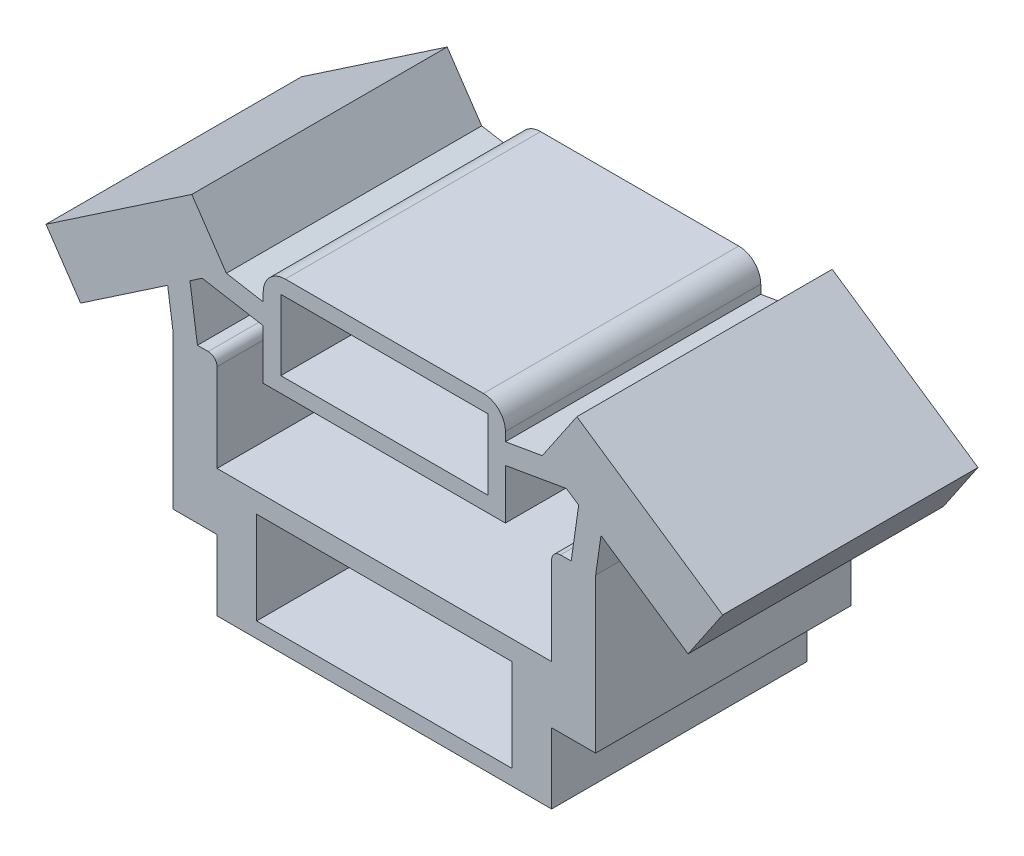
ISO-10303-21;
HEADER;
FILE_DESCRIPTION(('STEP AP214'),'2;1');
FILE_NAME('part.step','',(''),(''),'','','');
FILE_SCHEMA(('AUTOMOTIVE_DESIGN { 1 0 10303 214 1 1 1 1 }'));
ENDSEC;
DATA;
#1=APPLICATION_CONTEXT('core data for automotive mechanical design processes');
#2=APPLICATION_PROTOCOL_DEFINITION('international standard','automotive_design',2000,#1);
#3=PRODUCT_CONTEXT('',#1,'mechanical');
#4=PRODUCT('Part','Part','',(#3));
#5=PRODUCT_RELATED_PRODUCT_CATEGORY('part','',(#4));
#6=PRODUCT_DEFINITION_FORMATION('','',#4);
#7=PRODUCT_DEFINITION_CONTEXT('part definition',#1,'design');
#8=PRODUCT_DEFINITION('design','',#6,#7);
#9=PRODUCT_DEFINITION_SHAPE('','',#8);
#10=(LENGTH_UNIT() NAMED_UNIT(*) SI_UNIT(.MILLI.,.METRE.));
#11=(NAMED_UNIT(*) PLANE_ANGLE_UNIT() SI_UNIT($,.RADIAN.));
#12=(NAMED_UNIT(*) SI_UNIT($,.STERADIAN.) SOLID_ANGLE_UNIT());
#13=UNCERTAINTY_MEASURE_WITH_UNIT(LENGTH_MEASURE(1.E-05),#10,'distance_accuracy_value','');
#14=(GEOMETRIC_REPRESENTATION_CONTEXT(3) GLOBAL_UNCERTAINTY_ASSIGNED_CONTEXT((#13)) GLOBAL_UNIT_ASSIGNED_CONTEXT((#10,
#11,#12)) REPRESENTATION_CONTEXT('',''));
#15=CARTESIAN_POINT('',(0.,0.,0.));
#16=DIRECTION('',(0.,0.,1.));
#17=DIRECTION('',(1.,0.,0.));
#18=AXIS2_PLACEMENT_3D('',#15,#16,#17);
#19=CARTESIAN_POINT('',(3.8,1.4,5.8));
#20=DIRECTION('',(1.,0.,0.));
#21=DIRECTION('',(0.,0.,-1.));
#22=AXIS2_PLACEMENT_3D('',#19,#20,#21);
#23=PLANE('',#22);
#24=DIRECTION('',(0.,-1.,0.));
#25=VECTOR('',#24,1.);
#26=CARTESIAN_POINT('',(3.8,1.4,5.8));
#27=LINE('',#26,#25);
#28=CARTESIAN_POINT('',(3.8,3.4,5.8));
#29=VERTEX_POINT('',#28);
#30=CARTESIAN_POINT('',(3.8,1.4,5.8));
#31=VERTEX_POINT('',#30);
#32=EDGE_CURVE('E545',#29,#31,#27,.T.);
#33=ORIENTED_EDGE('',*,*,#32,.F.);
#34=DIRECTION('',(0.,0.,-1.));
#35=VECTOR('',#34,1.);
#36=CARTESIAN_POINT('',(3.8,3.4,5.8));
#37=LINE('',#36,#35);
#38=CARTESIAN_POINT('',(3.8,3.4,0.));
#39=VERTEX_POINT('',#38);
#40=EDGE_CURVE('E44',#29,#39,#37,.T.);
#41=ORIENTED_EDGE('',*,*,#40,.T.);
#42=DIRECTION('',(0.,-1.,0.));
#43=VECTOR('',#42,1.);
#44=CARTESIAN_POINT('',(3.8,1.4,0.));
#45=LINE('',#44,#43);
#46=CARTESIAN_POINT('',(3.8,1.4,0.));
#47=VERTEX_POINT('',#46);
#48=EDGE_CURVE('E544',#39,#47,#45,.T.);
#49=ORIENTED_EDGE('',*,*,#48,.T.);
#50=DIRECTION('',(0.,0.,-1.));
#51=VECTOR('',#50,1.);
#52=CARTESIAN_POINT('',(3.8,1.4,5.8));
#53=LINE('',#52,#51);
#54=EDGE_CURVE('E673',#31,#47,#53,.T.);
#55=ORIENTED_EDGE('',*,*,#54,.F.);
#56=EDGE_LOOP('',(#33,#41,#49,#55));
#57=FACE_BOUND('',#56,.T.);
#58=ADVANCED_FACE('F36',(#57),#23,.F.);
#59=CARTESIAN_POINT('',(-3.8,1.4,5.8));
#60=DIRECTION('',(0.,-1.,0.));
#61=DIRECTION('',(1.,0.,0.));
#62=AXIS2_PLACEMENT_3D('',#59,#60,#61);
#63=PLANE('',#62);
#64=DIRECTION('',(-1.,0.,0.));
#65=VECTOR('',#64,1.);
#66=CARTESIAN_POINT('',(-3.8,1.4,0.));
#67=LINE('',#66,#65);
#68=CARTESIAN_POINT('',(-3.8,1.4,0.));
#69=VERTEX_POINT('',#68);
#70=EDGE_CURVE('E587',#47,#69,#67,.T.);
#71=ORIENTED_EDGE('',*,*,#70,.T.);
#72=DIRECTION('',(0.,0.,-1.));
#73=VECTOR('',#72,1.);
#74=CARTESIAN_POINT('',(-3.8,1.4,5.8));
#75=LINE('',#74,#73);
#76=CARTESIAN_POINT('',(-3.8,1.4,5.8));
#77=VERTEX_POINT('',#76);
#78=EDGE_CURVE('E670',#77,#69,#75,.T.);
#79=ORIENTED_EDGE('',*,*,#78,.F.);
#80=DIRECTION('',(-1.,0.,0.));
#81=VECTOR('',#80,1.);
#82=CARTESIAN_POINT('',(-3.8,1.4,5.8));
#83=LINE('',#82,#81);
#84=EDGE_CURVE('E547',#31,#77,#83,.T.);
#85=ORIENTED_EDGE('',*,*,#84,.F.);
#86=ORIENTED_EDGE('',*,*,#54,.T.);
#87=EDGE_LOOP('',(#71,#79,#85,#86));
#88=FACE_BOUND('',#87,.T.);
#89=ADVANCED_FACE('F720',(#88),#63,.F.);
#90=CARTESIAN_POINT('',(-3.8,-1.4,5.8));
#91=DIRECTION('',(1.,0.,0.));
#92=DIRECTION('',(0.,0.,-1.));
#93=AXIS2_PLACEMENT_3D('',#90,#91,#92);
#94=PLANE('',#93);
#95=DIRECTION('',(0.,-1.,0.));
#96=VECTOR('',#95,1.);
#97=CARTESIAN_POINT('',(-3.8,-1.4,5.8));
#98=LINE('',#97,#96);
#99=CARTESIAN_POINT('',(-3.8,0.1,5.8));
#100=VERTEX_POINT('',#99);
#101=CARTESIAN_POINT('',(-3.8,-1.5,5.8));
#102=VERTEX_POINT('',#101);
#103=EDGE_CURVE('E551',#100,#102,#98,.T.);
#104=ORIENTED_EDGE('',*,*,#103,.F.);
#105=DIRECTION('',(0.,0.,-1.));
#106=VECTOR('',#105,1.);
#107=CARTESIAN_POINT('',(-3.8,0.1,5.8));
#108=LINE('',#107,#106);
#109=CARTESIAN_POINT('',(-3.8,0.1,0.));
#110=VERTEX_POINT('',#109);
#111=EDGE_CURVE('E482',#100,#110,#108,.T.);
#112=ORIENTED_EDGE('',*,*,#111,.T.);
#113=DIRECTION('',(0.,-1.,0.));
#114=VECTOR('',#113,1.);
#115=CARTESIAN_POINT('',(-3.8,-1.4,0.));
#116=LINE('',#115,#114);
#117=CARTESIAN_POINT('',(-3.8,-1.5,0.));
#118=VERTEX_POINT('',#117);
#119=EDGE_CURVE('E590',#110,#118,#116,.T.);
#120=ORIENTED_EDGE('',*,*,#119,.T.);
#121=DIRECTION('',(0.,0.,1.));
#122=VECTOR('',#121,1.);
#123=CARTESIAN_POINT('',(-3.8,-1.5,-7.60065786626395));
#124=LINE('',#123,#122);
#125=EDGE_CURVE('E382',#118,#102,#124,.T.);
#126=ORIENTED_EDGE('',*,*,#125,.T.);
#127=EDGE_LOOP('',(#104,#112,#120,#126));
#128=FACE_BOUND('',#127,.T.);
#129=ADVANCED_FACE('F783',(#128),#94,.F.);
#130=CARTESIAN_POINT('',(3.8,-1.4,5.8));
#131=DIRECTION('',(-1.,0.,0.));
#132=DIRECTION('',(0.,0.,1.));
#133=AXIS2_PLACEMENT_3D('',#130,#131,#132);
#134=PLANE('',#133);
#135=DIRECTION('',(0.,1.,0.));
#136=VECTOR('',#135,1.);
#137=CARTESIAN_POINT('',(3.8,-1.4,0.));
#138=LINE('',#137,#136);
#139=CARTESIAN_POINT('',(3.8,-1.5,0.));
#140=VERTEX_POINT('',#139);
#141=CARTESIAN_POINT('',(3.8,0.1,0.));
#142=VERTEX_POINT('',#141);
#143=EDGE_CURVE('E592',#140,#142,#138,.T.);
#144=ORIENTED_EDGE('',*,*,#143,.T.);
#145=DIRECTION('',(0.,0.,-1.));
#146=VECTOR('',#145,1.);
#147=CARTESIAN_POINT('',(3.8,0.1,5.8));
#148=LINE('',#147,#146);
#149=CARTESIAN_POINT('',(3.8,0.1,5.8));
#150=VERTEX_POINT('',#149);
#151=EDGE_CURVE('E667',#150,#142,#148,.T.);
#152=ORIENTED_EDGE('',*,*,#151,.F.);
#153=DIRECTION('',(0.,1.,0.));
#154=VECTOR('',#153,1.);
#155=CARTESIAN_POINT('',(3.8,-1.4,5.8));
#156=LINE('',#155,#154);
#157=CARTESIAN_POINT('',(3.8,-1.5,5.8));
#158=VERTEX_POINT('',#157);
#159=EDGE_CURVE('E553',#158,#150,#156,.T.);
#160=ORIENTED_EDGE('',*,*,#159,.F.);
#161=DIRECTION('',(0.,0.,1.));
#162=VECTOR('',#161,1.);
#163=CARTESIAN_POINT('',(3.8,-1.5,-7.60065786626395));
#164=LINE('',#163,#162);
#165=EDGE_CURVE('E379',#140,#158,#164,.T.);
#166=ORIENTED_EDGE('',*,*,#165,.F.);
#167=EDGE_LOOP('',(#144,#152,#160,#166));
#168=FACE_BOUND('',#167,.T.);
#169=ADVANCED_FACE('F856',(#168),#134,.F.);
#170=CARTESIAN_POINT('',(3.8,0.1,5.8));
#171=DIRECTION('',(0.,1.,0.));
#172=DIRECTION('',(0.,0.,1.));
#173=AXIS2_PLACEMENT_3D('',#170,#171,#172);
#174=PLANE('',#173);
#175=DIRECTION('',(1.,0.,0.));
#176=VECTOR('',#175,1.);
#177=CARTESIAN_POINT('',(3.8,0.1,0.));
#178=LINE('',#177,#176);
#179=CARTESIAN_POINT('',(4.8,0.1,0.));
#180=VERTEX_POINT('',#179);
#181=EDGE_CURVE('E594',#142,#180,#178,.T.);
#182=ORIENTED_EDGE('',*,*,#181,.T.);
#183=DIRECTION('',(0.,0.,-1.));
#184=VECTOR('',#183,1.);
#185=CARTESIAN_POINT('',(4.8,0.1,5.8));
#186=LINE('',#185,#184);
#187=CARTESIAN_POINT('',(4.8,0.1,5.8));
#188=VERTEX_POINT('',#187);
#189=EDGE_CURVE('E664',#188,#180,#186,.T.);
#190=ORIENTED_EDGE('',*,*,#189,.F.);
#191=DIRECTION('',(1.,0.,0.));
#192=VECTOR('',#191,1.);
#193=CARTESIAN_POINT('',(3.8,0.1,5.8));
#194=LINE('',#193,#192);
#195=EDGE_CURVE('E555',#150,#188,#194,.T.);
#196=ORIENTED_EDGE('',*,*,#195,.F.);
#197=ORIENTED_EDGE('',*,*,#151,.T.);
#198=EDGE_LOOP('',(#182,#190,#196,#197));
#199=FACE_BOUND('',#198,.T.);
#200=ADVANCED_FACE('F852',(#199),#174,.F.);
#201=CARTESIAN_POINT('',(4.8,3.6,5.8));
#202=DIRECTION('',(-1.,0.,0.));
#203=DIRECTION('',(0.,-1.,0.));
#204=AXIS2_PLACEMENT_3D('',#201,#202,#203);
#205=PLANE('',#204);
#206=DIRECTION('',(0.,1.,0.));
#207=VECTOR('',#206,1.);
#208=CARTESIAN_POINT('',(4.8,3.6,0.));
#209=LINE('',#208,#207);
#210=CARTESIAN_POINT('',(4.8,3.6,0.));
#211=VERTEX_POINT('',#210);
#212=EDGE_CURVE('E596',#180,#211,#209,.T.);
#213=ORIENTED_EDGE('',*,*,#212,.T.);
#214=DIRECTION('',(0.,0.,-1.));
#215=VECTOR('',#214,1.);
#216=CARTESIAN_POINT('',(4.8,3.6,5.8));
#217=LINE('',#216,#215);
#218=CARTESIAN_POINT('',(4.8,3.6,5.8));
#219=VERTEX_POINT('',#218);
#220=EDGE_CURVE('E661',#219,#211,#217,.T.);
#221=ORIENTED_EDGE('',*,*,#220,.F.);
#222=DIRECTION('',(0.,1.,0.));
#223=VECTOR('',#222,1.);
#224=CARTESIAN_POINT('',(4.8,3.6,5.8));
#225=LINE('',#224,#223);
#226=EDGE_CURVE('E557',#188,#219,#225,.T.);
#227=ORIENTED_EDGE('',*,*,#226,.F.);
#228=ORIENTED_EDGE('',*,*,#189,.T.);
#229=EDGE_LOOP('',(#213,#221,#227,#228));
#230=FACE_BOUND('',#229,.T.);
#231=ADVANCED_FACE('F846',(#230),#205,.F.);
#232=CARTESIAN_POINT('',(4.8,3.6,5.8));
#233=DIRECTION('',(-0.989776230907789,0.142628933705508,0.));
#234=DIRECTION('',(-0.142628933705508,-0.989776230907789,0.));
#235=AXIS2_PLACEMENT_3D('',#232,#233,#234);
#236=PLANE('',#235);
#237=DIRECTION('',(0.142628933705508,0.989776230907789,0.));
#238=VECTOR('',#237,1.);
#239=CARTESIAN_POINT('',(4.8,3.6,0.));
#240=LINE('',#239,#238);
#241=CARTESIAN_POINT('',(4.92123459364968,4.44130979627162,0.));
#242=VERTEX_POINT('',#241);
#243=EDGE_CURVE('E598',#211,#242,#240,.T.);
#244=ORIENTED_EDGE('',*,*,#243,.T.);
#245=DIRECTION('',(0.,0.,-1.));
#246=VECTOR('',#245,1.);
#247=CARTESIAN_POINT('',(4.92123459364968,4.44130979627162,5.8));
#248=LINE('',#247,#246);
#249=CARTESIAN_POINT('',(4.92123459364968,4.44130979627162,5.8));
#250=VERTEX_POINT('',#249);
#251=EDGE_CURVE('E658',#250,#242,#248,.T.);
#252=ORIENTED_EDGE('',*,*,#251,.F.);
#253=DIRECTION('',(0.142628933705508,0.989776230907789,0.));
#254=VECTOR('',#253,1.);
#255=CARTESIAN_POINT('',(4.8,3.6,5.8));
#256=LINE('',#255,#254);
#257=EDGE_CURVE('E559',#219,#250,#256,.T.);
#258=ORIENTED_EDGE('',*,*,#257,.F.);
#259=ORIENTED_EDGE('',*,*,#220,.T.);
#260=EDGE_LOOP('',(#244,#252,#258,#259));
#261=FACE_BOUND('',#260,.T.);
#262=ADVANCED_FACE('F842',(#261),#236,.F.);
#263=CARTESIAN_POINT('',(4.92123459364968,4.44130979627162,5.8));
#264=DIRECTION('',(0.560820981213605,0.827937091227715,0.));
#265=DIRECTION('',(-0.827937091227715,0.560820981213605,0.));
#266=AXIS2_PLACEMENT_3D('',#263,#264,#265);
#267=PLANE('',#266);
#268=DIRECTION('',(0.827937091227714,-0.560820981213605,0.));
#269=VECTOR('',#268,1.);
#270=CARTESIAN_POINT('',(4.92123459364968,4.44130979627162,0.));
#271=LINE('',#270,#269);
#272=CARTESIAN_POINT('',(6.89934507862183,3.10139414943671,0.));
#273=VERTEX_POINT('',#272);
#274=EDGE_CURVE('E600',#242,#273,#271,.T.);
#275=ORIENTED_EDGE('',*,*,#274,.T.);
#276=DIRECTION('',(0.,0.,-1.));
#277=VECTOR('',#276,1.);
#278=CARTESIAN_POINT('',(6.89934507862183,3.10139414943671,5.8));
#279=LINE('',#278,#277);
#280=CARTESIAN_POINT('',(6.89934507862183,3.10139414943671,5.8));
#281=VERTEX_POINT('',#280);
#282=EDGE_CURVE('E655',#281,#273,#279,.T.);
#283=ORIENTED_EDGE('',*,*,#282,.F.);
#284=DIRECTION('',(0.827937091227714,-0.560820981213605,0.));
#285=VECTOR('',#284,1.);
#286=CARTESIAN_POINT('',(4.92123459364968,4.44130979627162,5.8));
#287=LINE('',#286,#285);
#288=EDGE_CURVE('E561',#250,#281,#287,.T.);
#289=ORIENTED_EDGE('',*,*,#288,.F.);
#290=ORIENTED_EDGE('',*,*,#251,.T.);
#291=EDGE_LOOP('',(#275,#283,#289,#290));
#292=FACE_BOUND('',#291,.T.);
#293=ADVANCED_FACE('F837',(#292),#267,.F.);
#294=CARTESIAN_POINT('',(6.89934507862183,3.10139414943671,5.8));
#295=DIRECTION('',(-0.827937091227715,0.560820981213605,0.));
#296=DIRECTION('',(-0.560820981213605,-0.827937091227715,0.));
#297=AXIS2_PLACEMENT_3D('',#294,#295,#296);
#298=PLANE('',#297);
#299=DIRECTION('',(0.560820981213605,0.827937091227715,0.));
#300=VECTOR('',#299,1.);
#301=CARTESIAN_POINT('',(6.89934507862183,3.10139414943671,0.));
#302=LINE('',#301,#300);
#303=CARTESIAN_POINT('',(7.68449445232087,4.26050607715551,0.));
#304=VERTEX_POINT('',#303);
#305=EDGE_CURVE('E602',#273,#304,#302,.T.);
#306=ORIENTED_EDGE('',*,*,#305,.T.);
#307=DIRECTION('',(0.,0.,-1.));
#308=VECTOR('',#307,1.);
#309=CARTESIAN_POINT('',(7.68449445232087,4.26050607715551,5.8));
#310=LINE('',#309,#308);
#311=CARTESIAN_POINT('',(7.68449445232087,4.26050607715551,5.8));
#312=VERTEX_POINT('',#311);
#313=EDGE_CURVE('E652',#312,#304,#310,.T.);
#314=ORIENTED_EDGE('',*,*,#313,.F.);
#315=DIRECTION('',(0.560820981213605,0.827937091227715,0.));
#316=VECTOR('',#315,1.);
#317=CARTESIAN_POINT('',(6.89934507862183,3.10139414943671,5.8));
#318=LINE('',#317,#316);
#319=EDGE_CURVE('E563',#281,#312,#318,.T.);
#320=ORIENTED_EDGE('',*,*,#319,.F.);
#321=ORIENTED_EDGE('',*,*,#282,.T.);
#322=EDGE_LOOP('',(#306,#314,#320,#321));
#323=FACE_BOUND('',#322,.T.);
#324=ADVANCED_FACE('F831',(#323),#298,.F.);
#325=CARTESIAN_POINT('',(4.37274608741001,6.50379000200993,5.8));
#326=DIRECTION('',(-0.560820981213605,-0.827937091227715,0.));
#327=DIRECTION('',(0.827937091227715,-0.560820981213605,0.));
#328=AXIS2_PLACEMENT_3D('',#325,#326,#327);
#329=PLANE('',#328);
#330=DIRECTION('',(-0.827937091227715,0.560820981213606,0.));
#331=VECTOR('',#330,1.);
#332=CARTESIAN_POINT('',(4.37274608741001,6.50379000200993,0.));
#333=LINE('',#332,#331);
#334=CARTESIAN_POINT('',(4.37274608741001,6.50379000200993,0.));
#335=VERTEX_POINT('',#334);
#336=EDGE_CURVE('E604',#304,#335,#333,.T.);
#337=ORIENTED_EDGE('',*,*,#336,.T.);
#338=DIRECTION('',(0.,0.,-1.));
#339=VECTOR('',#338,1.);
#340=CARTESIAN_POINT('',(4.37274608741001,6.50379000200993,5.8));
#341=LINE('',#340,#339);
#342=CARTESIAN_POINT('',(4.37274608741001,6.50379000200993,5.8));
#343=VERTEX_POINT('',#342);
#344=EDGE_CURVE('E649',#343,#335,#341,.T.);
#345=ORIENTED_EDGE('',*,*,#344,.F.);
#346=DIRECTION('',(-0.827937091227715,0.560820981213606,0.));
#347=VECTOR('',#346,1.);
#348=CARTESIAN_POINT('',(4.37274608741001,6.50379000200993,5.8));
#349=LINE('',#348,#347);
#350=EDGE_CURVE('E565',#312,#343,#349,.T.);
#351=ORIENTED_EDGE('',*,*,#350,.F.);
#352=ORIENTED_EDGE('',*,*,#313,.T.);
#353=EDGE_LOOP('',(#337,#345,#351,#352));
#354=FACE_BOUND('',#353,.T.);
#355=ADVANCED_FACE('F827',(#354),#329,.F.);
#356=CARTESIAN_POINT('',(4.37274608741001,6.50379000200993,5.8));
#357=DIRECTION('',(0.827937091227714,-0.560820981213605,0.));
#358=DIRECTION('',(0.560820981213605,0.827937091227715,0.));
#359=AXIS2_PLACEMENT_3D('',#356,#357,#358);
#360=PLANE('',#359);
#361=DIRECTION('',(-0.560820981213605,-0.827937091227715,0.));
#362=VECTOR('',#361,1.);
#363=CARTESIAN_POINT('',(4.37274608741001,6.50379000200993,0.));
#364=LINE('',#363,#362);
#365=CARTESIAN_POINT('',(3.58759671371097,5.34467807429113,0.));
#366=VERTEX_POINT('',#365);
#367=EDGE_CURVE('E606',#335,#366,#364,.T.);
#368=ORIENTED_EDGE('',*,*,#367,.T.);
#369=DIRECTION('',(0.,0.,-1.));
#370=VECTOR('',#369,1.);
#371=CARTESIAN_POINT('',(3.58759671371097,5.34467807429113,5.8));
#372=LINE('',#371,#370);
#373=CARTESIAN_POINT('',(3.58759671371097,5.34467807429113,5.8));
#374=VERTEX_POINT('',#373);
#375=EDGE_CURVE('E646',#374,#366,#372,.T.);
#376=ORIENTED_EDGE('',*,*,#375,.F.);
#377=DIRECTION('',(-0.560820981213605,-0.827937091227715,0.));
#378=VECTOR('',#377,1.);
#379=CARTESIAN_POINT('',(4.37274608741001,6.50379000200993,5.8));
#380=LINE('',#379,#378);
#381=EDGE_CURVE('E567',#343,#374,#380,.T.);
#382=ORIENTED_EDGE('',*,*,#381,.F.);
#383=ORIENTED_EDGE('',*,*,#344,.T.);
#384=EDGE_LOOP('',(#368,#376,#382,#383));
#385=FACE_BOUND('',#384,.T.);
#386=ADVANCED_FACE('F822',(#385),#360,.F.);
#387=CARTESIAN_POINT('',(2.75,5.2,5.8));
#388=DIRECTION('',(0.170209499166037,-0.985407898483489,0.));
#389=DIRECTION('',(0.985407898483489,0.170209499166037,0.));
#390=AXIS2_PLACEMENT_3D('',#387,#388,#389);
#391=PLANE('',#390);
#392=DIRECTION('',(-0.98540789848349,-0.170209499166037,0.));
#393=VECTOR('',#392,1.);
#394=CARTESIAN_POINT('',(2.75,5.2,0.));
#395=LINE('',#394,#393);
#396=CARTESIAN_POINT('',(2.75,5.2,0.));
#397=VERTEX_POINT('',#396);
#398=EDGE_CURVE('E608',#366,#397,#395,.T.);
#399=ORIENTED_EDGE('',*,*,#398,.T.);
#400=DIRECTION('',(0.,0.,-1.));
#401=VECTOR('',#400,1.);
#402=CARTESIAN_POINT('',(2.75,5.2,5.8));
#403=LINE('',#402,#401);
#404=CARTESIAN_POINT('',(2.75,5.2,5.8));
#405=VERTEX_POINT('',#404);
#406=EDGE_CURVE('E643',#405,#397,#403,.T.);
#407=ORIENTED_EDGE('',*,*,#406,.F.);
#408=DIRECTION('',(-0.98540789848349,-0.170209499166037,0.));
#409=VECTOR('',#408,1.);
#410=CARTESIAN_POINT('',(2.75,5.2,5.8));
#411=LINE('',#410,#409);
#412=EDGE_CURVE('E569',#374,#405,#411,.T.);
#413=ORIENTED_EDGE('',*,*,#412,.F.);
#414=ORIENTED_EDGE('',*,*,#375,.T.);
#415=EDGE_LOOP('',(#399,#407,#413,#414));
#416=FACE_BOUND('',#415,.T.);
#417=ADVANCED_FACE('F816',(#416),#391,.F.);
#418=CARTESIAN_POINT('',(-2.75,5.2,5.8));
#419=DIRECTION('',(1.,0.,0.));
#420=DIRECTION('',(0.,0.,-1.));
#421=AXIS2_PLACEMENT_3D('',#418,#419,#420);
#422=PLANE('',#421);
#423=DIRECTION('',(0.,-1.,0.));
#424=VECTOR('',#423,1.);
#425=CARTESIAN_POINT('',(-2.75,5.2,5.8));
#426=LINE('',#425,#424);
#427=CARTESIAN_POINT('',(-2.75,4.73318823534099,5.8));
#428=VERTEX_POINT('',#427);
#429=CARTESIAN_POINT('',(-2.75,3.6,5.8));
#430=VERTEX_POINT('',#429);
#431=EDGE_CURVE('E571',#428,#430,#426,.T.);
#432=ORIENTED_EDGE('',*,*,#431,.F.);
#433=DIRECTION('',(0.,0.,-1.));
#434=VECTOR('',#433,1.);
#435=CARTESIAN_POINT('',(-2.75,4.73318823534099,5.8));
#436=LINE('',#435,#434);
#437=CARTESIAN_POINT('',(-2.75,4.73318823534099,0.));
#438=VERTEX_POINT('',#437);
#439=EDGE_CURVE('E535',#428,#438,#436,.T.);
#440=ORIENTED_EDGE('',*,*,#439,.T.);
#441=DIRECTION('',(0.,-1.,0.));
#442=VECTOR('',#441,1.);
#443=CARTESIAN_POINT('',(-2.75,5.2,0.));
#444=LINE('',#443,#442);
#445=CARTESIAN_POINT('',(-2.75,3.6,0.));
#446=VERTEX_POINT('',#445);
#447=EDGE_CURVE('E610',#438,#446,#444,.T.);
#448=ORIENTED_EDGE('',*,*,#447,.T.);
#449=DIRECTION('',(0.,0.,-1.));
#450=VECTOR('',#449,1.);
#451=CARTESIAN_POINT('',(-2.75,3.6,5.8));
#452=LINE('',#451,#450);
#453=EDGE_CURVE('E637',#430,#446,#452,.T.);
#454=ORIENTED_EDGE('',*,*,#453,.F.);
#455=EDGE_LOOP('',(#432,#440,#448,#454));
#456=FACE_BOUND('',#455,.T.);
#457=ADVANCED_FACE('F750',(#456),#422,.F.);
#458=CARTESIAN_POINT('',(-2.75,3.6,5.8));
#459=DIRECTION('',(0.,1.,0.));
#460=DIRECTION('',(0.,0.,1.));
#461=AXIS2_PLACEMENT_3D('',#458,#459,#460);
#462=PLANE('',#461);
#463=DIRECTION('',(1.,0.,0.));
#464=VECTOR('',#463,1.);
#465=CARTESIAN_POINT('',(-2.75,3.6,0.));
#466=LINE('',#465,#464);
#467=CARTESIAN_POINT('',(2.75,3.6,0.));
#468=VERTEX_POINT('',#467);
#469=EDGE_CURVE('E612',#446,#468,#466,.T.);
#470=ORIENTED_EDGE('',*,*,#469,.T.);
#471=DIRECTION('',(0.,0.,-1.));
#472=VECTOR('',#471,1.);
#473=CARTESIAN_POINT('',(2.75,3.6,5.8));
#474=LINE('',#473,#472);
#475=CARTESIAN_POINT('',(2.75,3.6,5.8));
#476=VERTEX_POINT('',#475);
#477=EDGE_CURVE('E634',#476,#468,#474,.T.);
#478=ORIENTED_EDGE('',*,*,#477,.F.);
#479=DIRECTION('',(1.,0.,0.));
#480=VECTOR('',#479,1.);
#481=CARTESIAN_POINT('',(-2.75,3.6,5.8));
#482=LINE('',#481,#480);
#483=EDGE_CURVE('E573',#430,#476,#482,.T.);
#484=ORIENTED_EDGE('',*,*,#483,.F.);
#485=ORIENTED_EDGE('',*,*,#453,.T.);
#486=EDGE_LOOP('',(#470,#478,#484,#485));
#487=FACE_BOUND('',#486,.T.);
#488=ADVANCED_FACE('F753',(#487),#462,.F.);
#489=CARTESIAN_POINT('',(2.75,4.73318823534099,5.8));
#490=DIRECTION('',(-1.,0.,0.));
#491=DIRECTION('',(0.,0.,1.));
#492=AXIS2_PLACEMENT_3D('',#489,#490,#491);
#493=PLANE('',#492);
#494=DIRECTION('',(0.,1.,0.));
#495=VECTOR('',#494,1.);
#496=CARTESIAN_POINT('',(2.75,4.73318823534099,0.));
#497=LINE('',#496,#495);
#498=CARTESIAN_POINT('',(2.75,4.73318823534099,0.));
#499=VERTEX_POINT('',#498);
#500=EDGE_CURVE('E614',#468,#499,#497,.T.);
#501=ORIENTED_EDGE('',*,*,#500,.T.);
#502=DIRECTION('',(0.,0.,-1.));
#503=VECTOR('',#502,1.);
#504=CARTESIAN_POINT('',(2.75,4.73318823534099,5.8));
#505=LINE('',#504,#503);
#506=CARTESIAN_POINT('',(2.75,4.73318823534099,5.8));
#507=VERTEX_POINT('',#506);
#508=EDGE_CURVE('E631',#507,#499,#505,.T.);
#509=ORIENTED_EDGE('',*,*,#508,.F.);
#510=DIRECTION('',(0.,1.,0.));
#511=VECTOR('',#510,1.);
#512=CARTESIAN_POINT('',(2.75,4.73318823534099,5.8));
#513=LINE('',#512,#511);
#514=EDGE_CURVE('E575',#476,#507,#513,.T.);
#515=ORIENTED_EDGE('',*,*,#514,.F.);
#516=ORIENTED_EDGE('',*,*,#477,.T.);
#517=EDGE_LOOP('',(#501,#509,#515,#516));
#518=FACE_BOUND('',#517,.T.);
#519=ADVANCED_FACE('F758',(#518),#493,.F.);
#520=CARTESIAN_POINT('',(2.75,4.73318823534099,5.8));
#521=DIRECTION('',(-0.170209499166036,0.98540789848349,0.));
#522=DIRECTION('',(-0.98540789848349,-0.170209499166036,0.));
#523=AXIS2_PLACEMENT_3D('',#520,#521,#522);
#524=PLANE('',#523);
#525=DIRECTION('',(0.98540789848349,0.170209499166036,0.));
#526=VECTOR('',#525,1.);
#527=CARTESIAN_POINT('',(2.75,4.73318823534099,0.));
#528=LINE('',#527,#526);
#529=CARTESIAN_POINT('',(4.13672146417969,4.97271662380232,0.));
#530=VERTEX_POINT('',#529);
#531=EDGE_CURVE('E616',#499,#530,#528,.T.);
#532=ORIENTED_EDGE('',*,*,#531,.T.);
#533=DIRECTION('',(0.,0.,-1.));
#534=VECTOR('',#533,1.);
#535=CARTESIAN_POINT('',(4.13672146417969,4.97271662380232,5.8));
#536=LINE('',#535,#534);
#537=CARTESIAN_POINT('',(4.13672146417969,4.97271662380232,5.8));
#538=VERTEX_POINT('',#537);
#539=EDGE_CURVE('E628',#538,#530,#536,.T.);
#540=ORIENTED_EDGE('',*,*,#539,.F.);
#541=DIRECTION('',(0.98540789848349,0.170209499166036,0.));
#542=VECTOR('',#541,1.);
#543=CARTESIAN_POINT('',(2.75,4.73318823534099,5.8));
#544=LINE('',#543,#542);
#545=EDGE_CURVE('E577',#507,#538,#544,.T.);
#546=ORIENTED_EDGE('',*,*,#545,.F.);
#547=ORIENTED_EDGE('',*,*,#508,.T.);
#548=EDGE_LOOP('',(#532,#540,#546,#547));
#549=FACE_BOUND('',#548,.T.);
#550=ADVANCED_FACE('F764',(#549),#524,.F.);
#551=CARTESIAN_POINT('',(4.13672146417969,4.97271662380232,5.8));
#552=DIRECTION('',(0.560820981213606,0.827937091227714,0.));
#553=DIRECTION('',(-0.827937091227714,0.560820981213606,0.));
#554=AXIS2_PLACEMENT_3D('',#551,#552,#553);
#555=PLANE('',#554);
#556=DIRECTION('',(0.827937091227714,-0.560820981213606,0.));
#557=VECTOR('',#556,1.);
#558=CARTESIAN_POINT('',(4.13672146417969,4.97271662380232,0.));
#559=LINE('',#558,#557);
#560=CARTESIAN_POINT('',(4.4149702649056,4.78423881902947,0.));
#561=VERTEX_POINT('',#560);
#562=EDGE_CURVE('E618',#530,#561,#559,.T.);
#563=ORIENTED_EDGE('',*,*,#562,.T.);
#564=DIRECTION('',(0.,0.,-1.));
#565=VECTOR('',#564,1.);
#566=CARTESIAN_POINT('',(4.4149702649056,4.78423881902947,5.8));
#567=LINE('',#566,#565);
#568=CARTESIAN_POINT('',(4.4149702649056,4.78423881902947,5.8));
#569=VERTEX_POINT('',#568);
#570=EDGE_CURVE('E625',#569,#561,#567,.T.);
#571=ORIENTED_EDGE('',*,*,#570,.F.);
#572=DIRECTION('',(0.827937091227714,-0.560820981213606,0.));
#573=VECTOR('',#572,1.);
#574=CARTESIAN_POINT('',(4.13672146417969,4.97271662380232,5.8));
#575=LINE('',#574,#573);
#576=EDGE_CURVE('E579',#538,#569,#575,.T.);
#577=ORIENTED_EDGE('',*,*,#576,.F.);
#578=ORIENTED_EDGE('',*,*,#539,.T.);
#579=EDGE_LOOP('',(#563,#571,#577,#578));
#580=FACE_BOUND('',#579,.T.);
#581=ADVANCED_FACE('F768',(#580),#555,.F.);
#582=CARTESIAN_POINT('',(4.24431884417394,3.6,5.8));
#583=DIRECTION('',(0.98977623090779,-0.142628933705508,0.));
#584=DIRECTION('',(0.142628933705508,0.98977623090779,0.));
#585=AXIS2_PLACEMENT_3D('',#582,#583,#584);
#586=PLANE('',#585);
#587=DIRECTION('',(-0.142628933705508,-0.98977623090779,0.));
#588=VECTOR('',#587,1.);
#589=CARTESIAN_POINT('',(4.24431884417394,3.6,0.));
#590=LINE('',#589,#588);
#591=CARTESIAN_POINT('',(4.24431884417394,3.6,0.));
#592=VERTEX_POINT('',#591);
#593=EDGE_CURVE('E620',#561,#592,#590,.T.);
#594=ORIENTED_EDGE('',*,*,#593,.T.);
#595=DIRECTION('',(0.,0.,-1.));
#596=VECTOR('',#595,1.);
#597=CARTESIAN_POINT('',(4.24431884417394,3.6,5.8));
#598=LINE('',#597,#596);
#599=CARTESIAN_POINT('',(4.24431884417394,3.6,5.8));
#600=VERTEX_POINT('',#599);
#601=EDGE_CURVE('E585',#600,#592,#598,.T.);
#602=ORIENTED_EDGE('',*,*,#601,.F.);
#603=DIRECTION('',(-0.142628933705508,-0.98977623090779,0.));
#604=VECTOR('',#603,1.);
#605=CARTESIAN_POINT('',(4.24431884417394,3.6,5.8));
#606=LINE('',#605,#604);
#607=EDGE_CURVE('E581',#569,#600,#606,.T.);
#608=ORIENTED_EDGE('',*,*,#607,.F.);
#609=ORIENTED_EDGE('',*,*,#570,.T.);
#610=EDGE_LOOP('',(#594,#602,#608,#609));
#611=FACE_BOUND('',#610,.T.);
#612=ADVANCED_FACE('F773',(#611),#586,.F.);
#613=CARTESIAN_POINT('',(3.8,3.6,5.8));
#614=DIRECTION('',(0.,-1.,0.));
#615=DIRECTION('',(0.,0.,-1.));
#616=AXIS2_PLACEMENT_3D('',#613,#614,#615);
#617=PLANE('',#616);
#618=DIRECTION('',(-1.,0.,0.));
#619=VECTOR('',#618,1.);
#620=CARTESIAN_POINT('',(3.8,3.6,0.));
#621=LINE('',#620,#619);
#622=CARTESIAN_POINT('',(4.,3.6,0.));
#623=VERTEX_POINT('',#622);
#624=EDGE_CURVE('E548',#592,#623,#621,.T.);
#625=ORIENTED_EDGE('',*,*,#624,.T.);
#626=DIRECTION('',(0.,0.,-1.));
#627=VECTOR('',#626,1.);
#628=CARTESIAN_POINT('',(4.,3.6,5.8));
#629=LINE('',#628,#627);
#630=CARTESIAN_POINT('',(4.,3.6,5.8));
#631=VERTEX_POINT('',#630);
#632=EDGE_CURVE('E11',#623,#631,#629,.F.);
#633=ORIENTED_EDGE('',*,*,#632,.T.);
#634=DIRECTION('',(-1.,0.,0.));
#635=VECTOR('',#634,1.);
#636=CARTESIAN_POINT('',(3.8,3.6,5.8));
#637=LINE('',#636,#635);
#638=EDGE_CURVE('E583',#600,#631,#637,.T.);
#639=ORIENTED_EDGE('',*,*,#638,.F.);
#640=ORIENTED_EDGE('',*,*,#601,.T.);
#641=EDGE_LOOP('',(#625,#633,#639,#640));
#642=FACE_BOUND('',#641,.T.);
#643=ADVANCED_FACE('F965',(#642),#617,.F.);
#644=CARTESIAN_POINT('',(0.,0.,5.8));
#645=DIRECTION('',(0.,0.,-1.));
#646=DIRECTION('',(-1.,0.,0.));
#647=AXIS2_PLACEMENT_3D('',#644,#645,#646);
#648=PLANE('',#647);
#649=DIRECTION('',(1.,0.,0.));
#650=VECTOR('',#649,1.);
#651=CARTESIAN_POINT('',(-2.9,-1.15,5.8));
#652=LINE('',#651,#650);
#653=CARTESIAN_POINT('',(-2.9,-1.15,5.8));
#654=VERTEX_POINT('',#653);
#655=CARTESIAN_POINT('',(2.9,-1.15,5.8));
#656=VERTEX_POINT('',#655);
#657=EDGE_CURVE('E368',#654,#656,#652,.T.);
#658=ORIENTED_EDGE('',*,*,#657,.F.);
#659=DIRECTION('',(0.,-1.,0.));
#660=VECTOR('',#659,1.);
#661=CARTESIAN_POINT('',(-2.9,-1.05,5.8));
#662=LINE('',#661,#660);
#663=CARTESIAN_POINT('',(-2.9,0.95,5.8));
#664=VERTEX_POINT('',#663);
#665=EDGE_CURVE('E359',#664,#654,#662,.T.);
#666=ORIENTED_EDGE('',*,*,#665,.F.);
#667=DIRECTION('',(1.,0.,0.));
#668=VECTOR('',#667,1.);
#669=CARTESIAN_POINT('',(-2.9,0.95,5.8));
#670=LINE('',#669,#668);
#671=CARTESIAN_POINT('',(2.9,0.95,5.8));
#672=VERTEX_POINT('',#671);
#673=EDGE_CURVE('E385',#664,#672,#670,.T.);
#674=ORIENTED_EDGE('',*,*,#673,.T.);
#675=DIRECTION('',(0.,1.,0.));
#676=VECTOR('',#675,1.);
#677=CARTESIAN_POINT('',(2.9,-1.05,5.8));
#678=LINE('',#677,#676);
#679=EDGE_CURVE('E424',#656,#672,#678,.T.);
#680=ORIENTED_EDGE('',*,*,#679,.F.);
#681=EDGE_LOOP('',(#658,#666,#674,#680));
#682=FACE_BOUND('',#681,.T.);
#683=DIRECTION('',(1.,0.,0.));
#684=VECTOR('',#683,1.);
#685=CARTESIAN_POINT('',(2.35,5.55,5.8));
#686=LINE('',#685,#684);
#687=CARTESIAN_POINT('',(-2.35,5.55,5.8));
#688=VERTEX_POINT('',#687);
#689=CARTESIAN_POINT('',(2.35,5.55,5.8));
#690=VERTEX_POINT('',#689);
#691=EDGE_CURVE('E394',#688,#690,#686,.T.);
#692=ORIENTED_EDGE('',*,*,#691,.T.);
#693=DIRECTION('',(0.,1.,0.));
#694=VECTOR('',#693,1.);
#695=CARTESIAN_POINT('',(2.35,5.55,5.8));
#696=LINE('',#695,#694);
#697=CARTESIAN_POINT('',(2.35,3.95,5.8));
#698=VERTEX_POINT('',#697);
#699=EDGE_CURVE('E432',#698,#690,#696,.T.);
#700=ORIENTED_EDGE('',*,*,#699,.F.);
#701=DIRECTION('',(1.,0.,0.));
#702=VECTOR('',#701,1.);
#703=CARTESIAN_POINT('',(-2.35,3.95,5.8));
#704=LINE('',#703,#702);
#705=CARTESIAN_POINT('',(-2.35,3.95,5.8));
#706=VERTEX_POINT('',#705);
#707=EDGE_CURVE('E436',#706,#698,#704,.T.);
#708=ORIENTED_EDGE('',*,*,#707,.F.);
#709=DIRECTION('',(0.,-1.,0.));
#710=VECTOR('',#709,1.);
#711=CARTESIAN_POINT('',(-2.35,5.55000000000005,5.8));
#712=LINE('',#711,#710);
#713=EDGE_CURVE('E422',#688,#706,#712,.T.);
#714=ORIENTED_EDGE('',*,*,#713,.F.);
#715=EDGE_LOOP('',(#692,#700,#708,#714));
#716=FACE_BOUND('',#715,.T.);
#717=DIRECTION('',(-1.,0.,0.));
#718=VECTOR('',#717,1.);
#719=CARTESIAN_POINT('',(-2.75,5.9,5.8));
#720=LINE('',#719,#718);
#721=CARTESIAN_POINT('',(2.25,5.9,5.8));
#722=VERTEX_POINT('',#721);
#723=CARTESIAN_POINT('',(-2.25,5.9,5.8));
#724=VERTEX_POINT('',#723);
#725=EDGE_CURVE('E398',#722,#724,#720,.T.);
#726=ORIENTED_EDGE('',*,*,#725,.T.);
#727=CARTESIAN_POINT('',(-2.25,5.4,5.8));
#728=DIRECTION('',(0.,0.,-1.));
#729=DIRECTION('',(-1.,0.,0.));
#730=AXIS2_PLACEMENT_3D('',#727,#728,#729);
#731=CIRCLE('',#730,0.5);
#732=CARTESIAN_POINT('',(-2.75,5.4,5.8));
#733=VERTEX_POINT('',#732);
#734=EDGE_CURVE('E685',#724,#733,#731,.F.);
#735=ORIENTED_EDGE('',*,*,#734,.T.);
#736=DIRECTION('',(0.,-1.,0.));
#737=VECTOR('',#736,1.);
#738=CARTESIAN_POINT('',(-2.75,5.2,5.8));
#739=LINE('',#738,#737);
#740=CARTESIAN_POINT('',(-2.75,5.2,5.8));
#741=VERTEX_POINT('',#740);
#742=EDGE_CURVE('E395',#733,#741,#739,.T.);
#743=ORIENTED_EDGE('',*,*,#742,.T.);
#744=DIRECTION('',(0.98540789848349,-0.170209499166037,0.));
#745=VECTOR('',#744,1.);
#746=CARTESIAN_POINT('',(-2.75,5.2,5.8));
#747=LINE('',#746,#745);
#748=CARTESIAN_POINT('',(-3.58759671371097,5.34467807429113,5.8));
#749=VERTEX_POINT('',#748);
#750=EDGE_CURVE('E458',#749,#741,#747,.T.);
#751=ORIENTED_EDGE('',*,*,#750,.F.);
#752=DIRECTION('',(0.560820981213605,-0.827937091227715,0.));
#753=VECTOR('',#752,1.);
#754=CARTESIAN_POINT('',(-4.37274608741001,6.50379000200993,5.8));
#755=LINE('',#754,#753);
#756=CARTESIAN_POINT('',(-4.37274608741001,6.50379000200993,5.8));
#757=VERTEX_POINT('',#756);
#758=EDGE_CURVE('E461',#757,#749,#755,.T.);
#759=ORIENTED_EDGE('',*,*,#758,.F.);
#760=DIRECTION('',(0.827937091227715,0.560820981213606,0.));
#761=VECTOR('',#760,1.);
#762=CARTESIAN_POINT('',(-4.37274608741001,6.50379000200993,5.8));
#763=LINE('',#762,#761);
#764=CARTESIAN_POINT('',(-7.68449445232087,4.26050607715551,5.8));
#765=VERTEX_POINT('',#764);
#766=EDGE_CURVE('E464',#765,#757,#763,.T.);
#767=ORIENTED_EDGE('',*,*,#766,.F.);
#768=DIRECTION('',(-0.560820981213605,0.827937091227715,0.));
#769=VECTOR('',#768,1.);
#770=CARTESIAN_POINT('',(-6.89934507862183,3.10139414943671,5.8));
#771=LINE('',#770,#769);
#772=CARTESIAN_POINT('',(-6.89934507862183,3.10139414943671,5.8));
#773=VERTEX_POINT('',#772);
#774=EDGE_CURVE('E467',#773,#765,#771,.T.);
#775=ORIENTED_EDGE('',*,*,#774,.F.);
#776=DIRECTION('',(-0.827937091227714,-0.560820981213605,0.));
#777=VECTOR('',#776,1.);
#778=CARTESIAN_POINT('',(-4.92123459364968,4.44130979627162,5.8));
#779=LINE('',#778,#777);
#780=CARTESIAN_POINT('',(-4.92123459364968,4.44130979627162,5.8));
#781=VERTEX_POINT('',#780);
#782=EDGE_CURVE('E470',#781,#773,#779,.T.);
#783=ORIENTED_EDGE('',*,*,#782,.F.);
#784=DIRECTION('',(-0.142628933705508,0.989776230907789,0.));
#785=VECTOR('',#784,1.);
#786=CARTESIAN_POINT('',(-4.8,3.6,5.8));
#787=LINE('',#786,#785);
#788=CARTESIAN_POINT('',(-4.8,3.6,5.8));
#789=VERTEX_POINT('',#788);
#790=EDGE_CURVE('E473',#789,#781,#787,.T.);
#791=ORIENTED_EDGE('',*,*,#790,.F.);
#792=DIRECTION('',(0.,1.,0.));
#793=VECTOR('',#792,1.);
#794=CARTESIAN_POINT('',(-4.8,3.6,5.8));
#795=LINE('',#794,#793);
#796=CARTESIAN_POINT('',(-4.8,0.1,5.8));
#797=VERTEX_POINT('',#796);
#798=EDGE_CURVE('E476',#797,#789,#795,.T.);
#799=ORIENTED_EDGE('',*,*,#798,.F.);
#800=DIRECTION('',(-1.,0.,0.));
#801=VECTOR('',#800,1.);
#802=CARTESIAN_POINT('',(-3.8,0.1,5.8));
#803=LINE('',#802,#801);
#804=EDGE_CURVE('E479',#100,#797,#803,.T.);
#805=ORIENTED_EDGE('',*,*,#804,.F.);
#806=ORIENTED_EDGE('',*,*,#103,.T.);
#807=DIRECTION('',(1.,0.,0.));
#808=VECTOR('',#807,1.);
#809=CARTESIAN_POINT('',(-3.8,-1.5,5.8));
#810=LINE('',#809,#808);
#811=EDGE_CURVE('E372',#102,#158,#810,.T.);
#812=ORIENTED_EDGE('',*,*,#811,.T.);
#813=ORIENTED_EDGE('',*,*,#159,.T.);
#814=ORIENTED_EDGE('',*,*,#195,.T.);
#815=ORIENTED_EDGE('',*,*,#226,.T.);
#816=ORIENTED_EDGE('',*,*,#257,.T.);
#817=ORIENTED_EDGE('',*,*,#288,.T.);
#818=ORIENTED_EDGE('',*,*,#319,.T.);
#819=ORIENTED_EDGE('',*,*,#350,.T.);
#820=ORIENTED_EDGE('',*,*,#381,.T.);
#821=ORIENTED_EDGE('',*,*,#412,.T.);
#822=DIRECTION('',(0.,1.,0.));
#823=VECTOR('',#822,1.);
#824=CARTESIAN_POINT('',(2.75,5.9,5.8));
#825=LINE('',#824,#823);
#826=CARTESIAN_POINT('',(2.75,5.4,5.8));
#827=VERTEX_POINT('',#826);
#828=EDGE_CURVE('E401',#405,#827,#825,.T.);
#829=ORIENTED_EDGE('',*,*,#828,.T.);
#830=CARTESIAN_POINT('',(2.25,5.4,5.8));
#831=DIRECTION('',(0.,0.,-1.));
#832=DIRECTION('',(-1.,0.,0.));
#833=AXIS2_PLACEMENT_3D('',#830,#831,#832);
#834=CIRCLE('',#833,0.5);
#835=EDGE_CURVE('E683',#827,#722,#834,.F.);
#836=ORIENTED_EDGE('',*,*,#835,.T.);
#837=EDGE_LOOP('',(#726,#735,#743,#751,#759,#767,#775,#783,#791,#799,#805,#806,#812,#813,#814,
#815,#816,#817,#818,#819,#820,#821,#829,#836));
#838=FACE_BOUND('',#837,.T.);
#839=DIRECTION('',(0.,-1.,0.));
#840=VECTOR('',#839,1.);
#841=CARTESIAN_POINT('',(-3.8,1.4,5.8));
#842=LINE('',#841,#840);
#843=CARTESIAN_POINT('',(-3.8,3.4,5.8));
#844=VERTEX_POINT('',#843);
#845=EDGE_CURVE('E443',#844,#77,#842,.T.);
#846=ORIENTED_EDGE('',*,*,#845,.F.);
#847=CARTESIAN_POINT('',(-4.,3.4,5.8));
#848=DIRECTION('',(0.,0.,-1.));
#849=DIRECTION('',(-1.,0.,0.));
#850=AXIS2_PLACEMENT_3D('',#847,#848,#849);
#851=CIRCLE('',#850,0.2);
#852=CARTESIAN_POINT('',(-4.,3.6,5.8));
#853=VERTEX_POINT('',#852);
#854=EDGE_CURVE('E706',#844,#853,#851,.F.);
#855=ORIENTED_EDGE('',*,*,#854,.T.);
#856=DIRECTION('',(1.,0.,0.));
#857=VECTOR('',#856,1.);
#858=CARTESIAN_POINT('',(-3.8,3.6,5.8));
#859=LINE('',#858,#857);
#860=CARTESIAN_POINT('',(-4.24431884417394,3.6,5.8));
#861=VERTEX_POINT('',#860);
#862=EDGE_CURVE('E445',#861,#853,#859,.T.);
#863=ORIENTED_EDGE('',*,*,#862,.F.);
#864=DIRECTION('',(0.142628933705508,-0.98977623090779,0.));
#865=VECTOR('',#864,1.);
#866=CARTESIAN_POINT('',(-4.24431884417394,3.6,5.8));
#867=LINE('',#866,#865);
#868=CARTESIAN_POINT('',(-4.4149702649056,4.78423881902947,5.8));
#869=VERTEX_POINT('',#868);
#870=EDGE_CURVE('E449',#869,#861,#867,.T.);
#871=ORIENTED_EDGE('',*,*,#870,.F.);
#872=DIRECTION('',(-0.827937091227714,-0.560820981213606,0.));
#873=VECTOR('',#872,1.);
#874=CARTESIAN_POINT('',(-4.13672146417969,4.97271662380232,5.8));
#875=LINE('',#874,#873);
#876=CARTESIAN_POINT('',(-4.13672146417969,4.97271662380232,5.8));
#877=VERTEX_POINT('',#876);
#878=EDGE_CURVE('E452',#877,#869,#875,.T.);
#879=ORIENTED_EDGE('',*,*,#878,.F.);
#880=DIRECTION('',(-0.98540789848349,0.170209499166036,0.));
#881=VECTOR('',#880,1.);
#882=CARTESIAN_POINT('',(-2.75,4.73318823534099,5.8));
#883=LINE('',#882,#881);
#884=EDGE_CURVE('E455',#428,#877,#883,.T.);
#885=ORIENTED_EDGE('',*,*,#884,.F.);
#886=ORIENTED_EDGE('',*,*,#431,.T.);
#887=ORIENTED_EDGE('',*,*,#483,.T.);
#888=ORIENTED_EDGE('',*,*,#514,.T.);
#889=ORIENTED_EDGE('',*,*,#545,.T.);
#890=ORIENTED_EDGE('',*,*,#576,.T.);
#891=ORIENTED_EDGE('',*,*,#607,.T.);
#892=ORIENTED_EDGE('',*,*,#638,.T.);
#893=CARTESIAN_POINT('',(4.,3.4,5.8));
#894=DIRECTION('',(0.,0.,-1.));
#895=DIRECTION('',(-1.,0.,0.));
#896=AXIS2_PLACEMENT_3D('',#893,#894,#895);
#897=CIRCLE('',#896,0.2);
#898=EDGE_CURVE('E51',#631,#29,#897,.F.);
#899=ORIENTED_EDGE('',*,*,#898,.T.);
#900=ORIENTED_EDGE('',*,*,#32,.T.);
#901=ORIENTED_EDGE('',*,*,#84,.T.);
#902=EDGE_LOOP('',(#846,#855,#863,#871,#879,#885,#886,#887,#888,#889,#890,#891,#892,#899,#900,#901));
#903=FACE_BOUND('',#902,.T.);
#904=ADVANCED_FACE('F722',(#682,#716,#838,#903),#648,.F.);
#905=CARTESIAN_POINT('',(0.,0.,0.));
#906=DIRECTION('',(0.,0.,-1.));
#907=DIRECTION('',(-1.,0.,0.));
#908=AXIS2_PLACEMENT_3D('',#905,#906,#907);
#909=PLANE('',#908);
#910=DIRECTION('',(0.,-1.,0.));
#911=VECTOR('',#910,1.);
#912=CARTESIAN_POINT('',(-2.9,-1.05,0.));
#913=LINE('',#912,#911);
#914=CARTESIAN_POINT('',(-2.9,0.95,0.));
#915=VERTEX_POINT('',#914);
#916=CARTESIAN_POINT('',(-2.9,-1.15,0.));
#917=VERTEX_POINT('',#916);
#918=EDGE_CURVE('E341',#915,#917,#913,.T.);
#919=ORIENTED_EDGE('',*,*,#918,.T.);
#920=DIRECTION('',(1.,0.,0.));
#921=VECTOR('',#920,1.);
#922=CARTESIAN_POINT('',(-2.9,-1.15,0.));
#923=LINE('',#922,#921);
#924=CARTESIAN_POINT('',(2.9,-1.15,0.));
#925=VERTEX_POINT('',#924);
#926=EDGE_CURVE('E347',#917,#925,#923,.T.);
#927=ORIENTED_EDGE('',*,*,#926,.T.);
#928=DIRECTION('',(0.,1.,0.));
#929=VECTOR('',#928,1.);
#930=CARTESIAN_POINT('',(2.9,-1.05,0.));
#931=LINE('',#930,#929);
#932=CARTESIAN_POINT('',(2.9,0.95,0.));
#933=VERTEX_POINT('',#932);
#934=EDGE_CURVE('E353',#925,#933,#931,.T.);
#935=ORIENTED_EDGE('',*,*,#934,.T.);
#936=DIRECTION('',(1.,0.,0.));
#937=VECTOR('',#936,1.);
#938=CARTESIAN_POINT('',(-2.9,0.95,0.));
#939=LINE('',#938,#937);
#940=EDGE_CURVE('E349',#915,#933,#939,.T.);
#941=ORIENTED_EDGE('',*,*,#940,.F.);
#942=EDGE_LOOP('',(#919,#927,#935,#941));
#943=FACE_BOUND('',#942,.T.);
#944=DIRECTION('',(0.,1.,0.));
#945=VECTOR('',#944,1.);
#946=CARTESIAN_POINT('',(2.35,5.55,0.));
#947=LINE('',#946,#945);
#948=CARTESIAN_POINT('',(2.35,3.95,0.));
#949=VERTEX_POINT('',#948);
#950=CARTESIAN_POINT('',(2.35,5.55,0.));
#951=VERTEX_POINT('',#950);
#952=EDGE_CURVE('E431',#949,#951,#947,.T.);
#953=ORIENTED_EDGE('',*,*,#952,.T.);
#954=DIRECTION('',(1.,0.,0.));
#955=VECTOR('',#954,1.);
#956=CARTESIAN_POINT('',(2.35,5.55,0.));
#957=LINE('',#956,#955);
#958=CARTESIAN_POINT('',(-2.35,5.55,0.));
#959=VERTEX_POINT('',#958);
#960=EDGE_CURVE('E397',#959,#951,#957,.T.);
#961=ORIENTED_EDGE('',*,*,#960,.F.);
#962=DIRECTION('',(0.,1.,0.));
#963=VECTOR('',#962,1.);
#964=CARTESIAN_POINT('',(-2.35,0.,0.));
#965=LINE('',#964,#963);
#966=CARTESIAN_POINT('',(-2.35,3.95,0.));
#967=VERTEX_POINT('',#966);
#968=EDGE_CURVE('E676',#967,#959,#965,.T.);
#969=ORIENTED_EDGE('',*,*,#968,.F.);
#970=DIRECTION('',(1.,0.,0.));
#971=VECTOR('',#970,1.);
#972=CARTESIAN_POINT('',(-2.35,3.95,0.));
#973=LINE('',#972,#971);
#974=EDGE_CURVE('E428',#967,#949,#973,.T.);
#975=ORIENTED_EDGE('',*,*,#974,.T.);
#976=EDGE_LOOP('',(#953,#961,#969,#975));
#977=FACE_BOUND('',#976,.T.);
#978=DIRECTION('',(0.,-1.,0.));
#979=VECTOR('',#978,1.);
#980=CARTESIAN_POINT('',(-2.75,5.2,0.));
#981=LINE('',#980,#979);
#982=CARTESIAN_POINT('',(-2.75,5.4,0.));
#983=VERTEX_POINT('',#982);
#984=CARTESIAN_POINT('',(-2.75,5.2,0.));
#985=VERTEX_POINT('',#984);
#986=EDGE_CURVE('E409',#983,#985,#981,.T.);
#987=ORIENTED_EDGE('',*,*,#986,.F.);
#988=CARTESIAN_POINT('',(-2.25,5.4,0.));
#989=DIRECTION('',(0.,0.,-1.));
#990=DIRECTION('',(-1.,0.,0.));
#991=AXIS2_PLACEMENT_3D('',#988,#989,#990);
#992=CIRCLE('',#991,0.5);
#993=CARTESIAN_POINT('',(-2.25,5.9,0.));
#994=VERTEX_POINT('',#993);
#995=EDGE_CURVE('E691',#983,#994,#992,.T.);
#996=ORIENTED_EDGE('',*,*,#995,.T.);
#997=DIRECTION('',(-1.,0.,0.));
#998=VECTOR('',#997,1.);
#999=CARTESIAN_POINT('',(-2.75,5.9,0.));
#1000=LINE('',#999,#998);
#1001=CARTESIAN_POINT('',(2.25,5.9,0.));
#1002=VERTEX_POINT('',#1001);
#1003=EDGE_CURVE('E412',#1002,#994,#1000,.T.);
#1004=ORIENTED_EDGE('',*,*,#1003,.F.);
#1005=CARTESIAN_POINT('',(2.25,5.4,0.));
#1006=DIRECTION('',(0.,0.,-1.));
#1007=DIRECTION('',(-1.,0.,0.));
#1008=AXIS2_PLACEMENT_3D('',#1005,#1006,#1007);
#1009=CIRCLE('',#1008,0.5);
#1010=CARTESIAN_POINT('',(2.75,5.4,0.));
#1011=VERTEX_POINT('',#1010);
#1012=EDGE_CURVE('E689',#1002,#1011,#1009,.T.);
#1013=ORIENTED_EDGE('',*,*,#1012,.T.);
#1014=DIRECTION('',(0.,1.,0.));
#1015=VECTOR('',#1014,1.);
#1016=CARTESIAN_POINT('',(2.75,5.9,0.));
#1017=LINE('',#1016,#1015);
#1018=EDGE_CURVE('E415',#397,#1011,#1017,.T.);
#1019=ORIENTED_EDGE('',*,*,#1018,.F.);
#1020=ORIENTED_EDGE('',*,*,#398,.F.);
#1021=ORIENTED_EDGE('',*,*,#367,.F.);
#1022=ORIENTED_EDGE('',*,*,#336,.F.);
#1023=ORIENTED_EDGE('',*,*,#305,.F.);
#1024=ORIENTED_EDGE('',*,*,#274,.F.);
#1025=ORIENTED_EDGE('',*,*,#243,.F.);
#1026=ORIENTED_EDGE('',*,*,#212,.F.);
#1027=ORIENTED_EDGE('',*,*,#181,.F.);
#1028=ORIENTED_EDGE('',*,*,#143,.F.);
#1029=DIRECTION('',(1.,0.,0.));
#1030=VECTOR('',#1029,1.);
#1031=CARTESIAN_POINT('',(-3.8,-1.5,0.));
#1032=LINE('',#1031,#1030);
#1033=EDGE_CURVE('E376',#118,#140,#1032,.T.);
#1034=ORIENTED_EDGE('',*,*,#1033,.F.);
#1035=ORIENTED_EDGE('',*,*,#119,.F.);
#1036=DIRECTION('',(-1.,0.,0.));
#1037=VECTOR('',#1036,1.);
#1038=CARTESIAN_POINT('',(-3.8,0.1,0.));
#1039=LINE('',#1038,#1037);
#1040=CARTESIAN_POINT('',(-4.8,0.1,0.));
#1041=VERTEX_POINT('',#1040);
#1042=EDGE_CURVE('E446',#110,#1041,#1039,.T.);
#1043=ORIENTED_EDGE('',*,*,#1042,.T.);
#1044=DIRECTION('',(0.,1.,0.));
#1045=VECTOR('',#1044,1.);
#1046=CARTESIAN_POINT('',(-4.8,3.6,0.));
#1047=LINE('',#1046,#1045);
#1048=CARTESIAN_POINT('',(-4.8,3.6,0.));
#1049=VERTEX_POINT('',#1048);
#1050=EDGE_CURVE('E514',#1041,#1049,#1047,.T.);
#1051=ORIENTED_EDGE('',*,*,#1050,.T.);
#1052=DIRECTION('',(-0.142628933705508,0.989776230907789,0.));
#1053=VECTOR('',#1052,1.);
#1054=CARTESIAN_POINT('',(-4.8,3.6,0.));
#1055=LINE('',#1054,#1053);
#1056=CARTESIAN_POINT('',(-4.92123459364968,4.44130979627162,0.));
#1057=VERTEX_POINT('',#1056);
#1058=EDGE_CURVE('E511',#1049,#1057,#1055,.T.);
#1059=ORIENTED_EDGE('',*,*,#1058,.T.);
#1060=DIRECTION('',(-0.827937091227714,-0.560820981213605,0.));
#1061=VECTOR('',#1060,1.);
#1062=CARTESIAN_POINT('',(-4.92123459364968,4.44130979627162,0.));
#1063=LINE('',#1062,#1061);
#1064=CARTESIAN_POINT('',(-6.89934507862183,3.10139414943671,0.));
#1065=VERTEX_POINT('',#1064);
#1066=EDGE_CURVE('E508',#1057,#1065,#1063,.T.);
#1067=ORIENTED_EDGE('',*,*,#1066,.T.);
#1068=DIRECTION('',(-0.560820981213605,0.827937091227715,0.));
#1069=VECTOR('',#1068,1.);
#1070=CARTESIAN_POINT('',(-6.89934507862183,3.10139414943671,0.));
#1071=LINE('',#1070,#1069);
#1072=CARTESIAN_POINT('',(-7.68449445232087,4.26050607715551,0.));
#1073=VERTEX_POINT('',#1072);
#1074=EDGE_CURVE('E505',#1065,#1073,#1071,.T.);
#1075=ORIENTED_EDGE('',*,*,#1074,.T.);
#1076=DIRECTION('',(0.827937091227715,0.560820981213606,0.));
#1077=VECTOR('',#1076,1.);
#1078=CARTESIAN_POINT('',(-4.37274608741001,6.50379000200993,0.));
#1079=LINE('',#1078,#1077);
#1080=CARTESIAN_POINT('',(-4.37274608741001,6.50379000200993,0.));
#1081=VERTEX_POINT('',#1080);
#1082=EDGE_CURVE('E502',#1073,#1081,#1079,.T.);
#1083=ORIENTED_EDGE('',*,*,#1082,.T.);
#1084=DIRECTION('',(0.560820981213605,-0.827937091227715,0.));
#1085=VECTOR('',#1084,1.);
#1086=CARTESIAN_POINT('',(-4.37274608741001,6.50379000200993,0.));
#1087=LINE('',#1086,#1085);
#1088=CARTESIAN_POINT('',(-3.58759671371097,5.34467807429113,0.));
#1089=VERTEX_POINT('',#1088);
#1090=EDGE_CURVE('E499',#1081,#1089,#1087,.T.);
#1091=ORIENTED_EDGE('',*,*,#1090,.T.);
#1092=DIRECTION('',(0.98540789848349,-0.170209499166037,0.));
#1093=VECTOR('',#1092,1.);
#1094=CARTESIAN_POINT('',(-2.75,5.2,0.));
#1095=LINE('',#1094,#1093);
#1096=EDGE_CURVE('E496',#1089,#985,#1095,.T.);
#1097=ORIENTED_EDGE('',*,*,#1096,.T.);
#1098=EDGE_LOOP('',(#987,#996,#1004,#1013,#1019,#1020,#1021,#1022,#1023,#1024,#1025,#1026,#1027,
#1028,#1034,#1035,#1043,#1051,#1059,#1067,#1075,#1083,#1091,#1097));
#1099=FACE_BOUND('',#1098,.T.);
#1100=DIRECTION('',(1.,0.,0.));
#1101=VECTOR('',#1100,1.);
#1102=CARTESIAN_POINT('',(-3.8,3.6,0.));
#1103=LINE('',#1102,#1101);
#1104=CARTESIAN_POINT('',(-4.24431884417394,3.6,0.));
#1105=VERTEX_POINT('',#1104);
#1106=CARTESIAN_POINT('',(-4.,3.6,0.));
#1107=VERTEX_POINT('',#1106);
#1108=EDGE_CURVE('E484',#1105,#1107,#1103,.T.);
#1109=ORIENTED_EDGE('',*,*,#1108,.T.);
#1110=CARTESIAN_POINT('',(-4.,3.4,0.));
#1111=DIRECTION('',(0.,0.,-1.));
#1112=DIRECTION('',(-1.,0.,0.));
#1113=AXIS2_PLACEMENT_3D('',#1110,#1111,#1112);
#1114=CIRCLE('',#1113,0.2);
#1115=CARTESIAN_POINT('',(-3.8,3.4,0.));
#1116=VERTEX_POINT('',#1115);
#1117=EDGE_CURVE('E701',#1107,#1116,#1114,.T.);
#1118=ORIENTED_EDGE('',*,*,#1117,.T.);
#1119=DIRECTION('',(0.,-1.,0.));
#1120=VECTOR('',#1119,1.);
#1121=CARTESIAN_POINT('',(-3.8,1.4,0.));
#1122=LINE('',#1121,#1120);
#1123=EDGE_CURVE('E352',#1116,#69,#1122,.T.);
#1124=ORIENTED_EDGE('',*,*,#1123,.T.);
#1125=ORIENTED_EDGE('',*,*,#70,.F.);
#1126=ORIENTED_EDGE('',*,*,#48,.F.);
#1127=CARTESIAN_POINT('',(4.,3.4,0.));
#1128=DIRECTION('',(0.,0.,-1.));
#1129=DIRECTION('',(-1.,0.,0.));
#1130=AXIS2_PLACEMENT_3D('',#1127,#1128,#1129);
#1131=CIRCLE('',#1130,0.2);
#1132=EDGE_CURVE('E699',#39,#623,#1131,.T.);
#1133=ORIENTED_EDGE('',*,*,#1132,.T.);
#1134=ORIENTED_EDGE('',*,*,#624,.F.);
#1135=ORIENTED_EDGE('',*,*,#593,.F.);
#1136=ORIENTED_EDGE('',*,*,#562,.F.);
#1137=ORIENTED_EDGE('',*,*,#531,.F.);
#1138=ORIENTED_EDGE('',*,*,#500,.F.);
#1139=ORIENTED_EDGE('',*,*,#469,.F.);
#1140=ORIENTED_EDGE('',*,*,#447,.F.);
#1141=DIRECTION('',(-0.98540789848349,0.170209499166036,0.));
#1142=VECTOR('',#1141,1.);
#1143=CARTESIAN_POINT('',(-2.75,4.73318823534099,0.));
#1144=LINE('',#1143,#1142);
#1145=CARTESIAN_POINT('',(-4.13672146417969,4.97271662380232,0.));
#1146=VERTEX_POINT('',#1145);
#1147=EDGE_CURVE('E493',#438,#1146,#1144,.T.);
#1148=ORIENTED_EDGE('',*,*,#1147,.T.);
#1149=DIRECTION('',(-0.827937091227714,-0.560820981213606,0.));
#1150=VECTOR('',#1149,1.);
#1151=CARTESIAN_POINT('',(-4.13672146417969,4.97271662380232,0.));
#1152=LINE('',#1151,#1150);
#1153=CARTESIAN_POINT('',(-4.4149702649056,4.78423881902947,0.));
#1154=VERTEX_POINT('',#1153);
#1155=EDGE_CURVE('E490',#1146,#1154,#1152,.T.);
#1156=ORIENTED_EDGE('',*,*,#1155,.T.);
#1157=DIRECTION('',(0.142628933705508,-0.98977623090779,0.));
#1158=VECTOR('',#1157,1.);
#1159=CARTESIAN_POINT('',(-4.24431884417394,3.6,0.));
#1160=LINE('',#1159,#1158);
#1161=EDGE_CURVE('E487',#1154,#1105,#1160,.T.);
#1162=ORIENTED_EDGE('',*,*,#1161,.T.);
#1163=EDGE_LOOP('',(#1109,#1118,#1124,#1125,#1126,#1133,#1134,#1135,#1136,#1137,#1138,#1139,
#1140,#1148,#1156,#1162));
#1164=FACE_BOUND('',#1163,.T.);
#1165=ADVANCED_FACE('F343',(#943,#977,#1099,#1164),#909,.T.);
#1166=CARTESIAN_POINT('',(-3.8,1.4,5.8));
#1167=DIRECTION('',(1.,0.,0.));
#1168=DIRECTION('',(0.,0.,-1.));
#1169=AXIS2_PLACEMENT_3D('',#1166,#1167,#1168);
#1170=PLANE('',#1169);
#1171=ORIENTED_EDGE('',*,*,#1123,.F.);
#1172=DIRECTION('',(0.,0.,-1.));
#1173=VECTOR('',#1172,1.);
#1174=CARTESIAN_POINT('',(-3.8,3.4,5.8));
#1175=LINE('',#1174,#1173);
#1176=EDGE_CURVE('E703',#1116,#844,#1175,.F.);
#1177=ORIENTED_EDGE('',*,*,#1176,.T.);
#1178=ORIENTED_EDGE('',*,*,#845,.T.);
#1179=ORIENTED_EDGE('',*,*,#78,.T.);
#1180=EDGE_LOOP('',(#1171,#1177,#1178,#1179));
#1181=FACE_BOUND('',#1180,.T.);
#1182=ADVANCED_FACE('F960',(#1181),#1170,.T.);
#1183=CARTESIAN_POINT('',(-3.8,3.6,5.8));
#1184=DIRECTION('',(0.,1.,0.));
#1185=DIRECTION('',(0.,0.,1.));
#1186=AXIS2_PLACEMENT_3D('',#1183,#1184,#1185);
#1187=PLANE('',#1186);
#1188=ORIENTED_EDGE('',*,*,#862,.T.);
#1189=DIRECTION('',(0.,0.,-1.));
#1190=VECTOR('',#1189,1.);
#1191=CARTESIAN_POINT('',(-4.,3.6,5.8));
#1192=LINE('',#1191,#1190);
#1193=EDGE_CURVE('E696',#853,#1107,#1192,.T.);
#1194=ORIENTED_EDGE('',*,*,#1193,.T.);
#1195=ORIENTED_EDGE('',*,*,#1108,.F.);
#1196=DIRECTION('',(0.,0.,-1.));
#1197=VECTOR('',#1196,1.);
#1198=CARTESIAN_POINT('',(-4.24431884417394,3.6,5.8));
#1199=LINE('',#1198,#1197);
#1200=EDGE_CURVE('E542',#861,#1105,#1199,.T.);
#1201=ORIENTED_EDGE('',*,*,#1200,.F.);
#1202=EDGE_LOOP('',(#1188,#1194,#1195,#1201));
#1203=FACE_BOUND('',#1202,.T.);
#1204=ADVANCED_FACE('F732',(#1203),#1187,.T.);
#1205=CARTESIAN_POINT('',(-4.24431884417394,3.6,5.8));
#1206=DIRECTION('',(0.98977623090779,0.142628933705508,0.));
#1207=DIRECTION('',(-0.142628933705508,0.98977623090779,0.));
#1208=AXIS2_PLACEMENT_3D('',#1205,#1206,#1207);
#1209=PLANE('',#1208);
#1210=ORIENTED_EDGE('',*,*,#1161,.F.);
#1211=DIRECTION('',(0.,0.,-1.));
#1212=VECTOR('',#1211,1.);
#1213=CARTESIAN_POINT('',(-4.4149702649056,4.78423881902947,5.8));
#1214=LINE('',#1213,#1212);
#1215=EDGE_CURVE('E540',#869,#1154,#1214,.T.);
#1216=ORIENTED_EDGE('',*,*,#1215,.F.);
#1217=ORIENTED_EDGE('',*,*,#870,.T.);
#1218=ORIENTED_EDGE('',*,*,#1200,.T.);
#1219=EDGE_LOOP('',(#1210,#1216,#1217,#1218));
#1220=FACE_BOUND('',#1219,.T.);
#1221=ADVANCED_FACE('F736',(#1220),#1209,.T.);
#1222=CARTESIAN_POINT('',(-4.13672146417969,4.97271662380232,5.8));
#1223=DIRECTION('',(0.560820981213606,-0.827937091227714,0.));
#1224=DIRECTION('',(0.827937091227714,0.560820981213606,0.));
#1225=AXIS2_PLACEMENT_3D('',#1222,#1223,#1224);
#1226=PLANE('',#1225);
#1227=ORIENTED_EDGE('',*,*,#1155,.F.);
#1228=DIRECTION('',(0.,0.,-1.));
#1229=VECTOR('',#1228,1.);
#1230=CARTESIAN_POINT('',(-4.13672146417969,4.97271662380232,5.8));
#1231=LINE('',#1230,#1229);
#1232=EDGE_CURVE('E538',#877,#1146,#1231,.T.);
#1233=ORIENTED_EDGE('',*,*,#1232,.F.);
#1234=ORIENTED_EDGE('',*,*,#878,.T.);
#1235=ORIENTED_EDGE('',*,*,#1215,.T.);
#1236=EDGE_LOOP('',(#1227,#1233,#1234,#1235));
#1237=FACE_BOUND('',#1236,.T.);
#1238=ADVANCED_FACE('F741',(#1237),#1226,.T.);
#1239=CARTESIAN_POINT('',(-2.75,4.73318823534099,5.8));
#1240=DIRECTION('',(-0.170209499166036,-0.98540789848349,0.));
#1241=DIRECTION('',(0.98540789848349,-0.170209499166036,0.));
#1242=AXIS2_PLACEMENT_3D('',#1239,#1240,#1241);
#1243=PLANE('',#1242);
#1244=ORIENTED_EDGE('',*,*,#1147,.F.);
#1245=ORIENTED_EDGE('',*,*,#439,.F.);
#1246=ORIENTED_EDGE('',*,*,#884,.T.);
#1247=ORIENTED_EDGE('',*,*,#1232,.T.);
#1248=EDGE_LOOP('',(#1244,#1245,#1246,#1247));
#1249=FACE_BOUND('',#1248,.T.);
#1250=ADVANCED_FACE('F744',(#1249),#1243,.T.);
#1251=CARTESIAN_POINT('',(-2.75,5.2,5.8));
#1252=DIRECTION('',(0.170209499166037,0.985407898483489,0.));
#1253=DIRECTION('',(-0.985407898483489,0.170209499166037,0.));
#1254=AXIS2_PLACEMENT_3D('',#1251,#1252,#1253);
#1255=PLANE('',#1254);
#1256=ORIENTED_EDGE('',*,*,#1096,.F.);
#1257=DIRECTION('',(0.,0.,-1.));
#1258=VECTOR('',#1257,1.);
#1259=CARTESIAN_POINT('',(-3.58759671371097,5.34467807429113,5.8));
#1260=LINE('',#1259,#1258);
#1261=EDGE_CURVE('E533',#749,#1089,#1260,.T.);
#1262=ORIENTED_EDGE('',*,*,#1261,.F.);
#1263=ORIENTED_EDGE('',*,*,#750,.T.);
#1264=DIRECTION('',(0.,0.,-1.));
#1265=VECTOR('',#1264,1.);
#1266=CARTESIAN_POINT('',(-2.75,5.2,5.8));
#1267=LINE('',#1266,#1265);
#1268=EDGE_CURVE('E640',#741,#985,#1267,.T.);
#1269=ORIENTED_EDGE('',*,*,#1268,.T.);
#1270=EDGE_LOOP('',(#1256,#1262,#1263,#1269));
#1271=FACE_BOUND('',#1270,.T.);
#1272=ADVANCED_FACE('F893',(#1271),#1255,.T.);
#1273=CARTESIAN_POINT('',(-4.37274608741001,6.50379000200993,5.8));
#1274=DIRECTION('',(0.827937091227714,0.560820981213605,0.));
#1275=DIRECTION('',(-0.560820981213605,0.827937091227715,0.));
#1276=AXIS2_PLACEMENT_3D('',#1273,#1274,#1275);
#1277=PLANE('',#1276);
#1278=ORIENTED_EDGE('',*,*,#1090,.F.);
#1279=DIRECTION('',(0.,0.,-1.));
#1280=VECTOR('',#1279,1.);
#1281=CARTESIAN_POINT('',(-4.37274608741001,6.50379000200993,5.8));
#1282=LINE('',#1281,#1280);
#1283=EDGE_CURVE('E531',#757,#1081,#1282,.T.);
#1284=ORIENTED_EDGE('',*,*,#1283,.F.);
#1285=ORIENTED_EDGE('',*,*,#758,.T.);
#1286=ORIENTED_EDGE('',*,*,#1261,.T.);
#1287=EDGE_LOOP('',(#1278,#1284,#1285,#1286));
#1288=FACE_BOUND('',#1287,.T.);
#1289=ADVANCED_FACE('F889',(#1288),#1277,.T.);
#1290=CARTESIAN_POINT('',(-4.37274608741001,6.50379000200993,5.8));
#1291=DIRECTION('',(-0.560820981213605,0.827937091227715,0.));
#1292=DIRECTION('',(-0.827937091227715,-0.560820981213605,0.));
#1293=AXIS2_PLACEMENT_3D('',#1290,#1291,#1292);
#1294=PLANE('',#1293);
#1295=ORIENTED_EDGE('',*,*,#1082,.F.);
#1296=DIRECTION('',(0.,0.,-1.));
#1297=VECTOR('',#1296,1.);
#1298=CARTESIAN_POINT('',(-7.68449445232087,4.26050607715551,5.8));
#1299=LINE('',#1298,#1297);
#1300=EDGE_CURVE('E529',#765,#1073,#1299,.T.);
#1301=ORIENTED_EDGE('',*,*,#1300,.F.);
#1302=ORIENTED_EDGE('',*,*,#766,.T.);
#1303=ORIENTED_EDGE('',*,*,#1283,.T.);
#1304=EDGE_LOOP('',(#1295,#1301,#1302,#1303));
#1305=FACE_BOUND('',#1304,.T.);
#1306=ADVANCED_FACE('F885',(#1305),#1294,.T.);
#1307=CARTESIAN_POINT('',(-6.89934507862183,3.10139414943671,5.8));
#1308=DIRECTION('',(-0.827937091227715,-0.560820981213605,0.));
#1309=DIRECTION('',(0.560820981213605,-0.827937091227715,0.));
#1310=AXIS2_PLACEMENT_3D('',#1307,#1308,#1309);
#1311=PLANE('',#1310);
#1312=ORIENTED_EDGE('',*,*,#1074,.F.);
#1313=DIRECTION('',(0.,0.,-1.));
#1314=VECTOR('',#1313,1.);
#1315=CARTESIAN_POINT('',(-6.89934507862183,3.10139414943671,5.8));
#1316=LINE('',#1315,#1314);
#1317=EDGE_CURVE('E527',#773,#1065,#1316,.T.);
#1318=ORIENTED_EDGE('',*,*,#1317,.F.);
#1319=ORIENTED_EDGE('',*,*,#774,.T.);
#1320=ORIENTED_EDGE('',*,*,#1300,.T.);
#1321=EDGE_LOOP('',(#1312,#1318,#1319,#1320));
#1322=FACE_BOUND('',#1321,.T.);
#1323=ADVANCED_FACE('F881',(#1322),#1311,.T.);
#1324=CARTESIAN_POINT('',(-4.92123459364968,4.44130979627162,5.8));
#1325=DIRECTION('',(0.560820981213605,-0.827937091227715,0.));
#1326=DIRECTION('',(0.827937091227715,0.560820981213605,0.));
#1327=AXIS2_PLACEMENT_3D('',#1324,#1325,#1326);
#1328=PLANE('',#1327);
#1329=ORIENTED_EDGE('',*,*,#1066,.F.);
#1330=DIRECTION('',(0.,0.,-1.));
#1331=VECTOR('',#1330,1.);
#1332=CARTESIAN_POINT('',(-4.92123459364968,4.44130979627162,5.8));
#1333=LINE('',#1332,#1331);
#1334=EDGE_CURVE('E525',#781,#1057,#1333,.T.);
#1335=ORIENTED_EDGE('',*,*,#1334,.F.);
#1336=ORIENTED_EDGE('',*,*,#782,.T.);
#1337=ORIENTED_EDGE('',*,*,#1317,.T.);
#1338=EDGE_LOOP('',(#1329,#1335,#1336,#1337));
#1339=FACE_BOUND('',#1338,.T.);
#1340=ADVANCED_FACE('F877',(#1339),#1328,.T.);
#1341=CARTESIAN_POINT('',(-4.8,3.6,5.8));
#1342=DIRECTION('',(-0.989776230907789,-0.142628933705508,0.));
#1343=DIRECTION('',(0.142628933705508,-0.989776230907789,0.));
#1344=AXIS2_PLACEMENT_3D('',#1341,#1342,#1343);
#1345=PLANE('',#1344);
#1346=ORIENTED_EDGE('',*,*,#1058,.F.);
#1347=DIRECTION('',(0.,0.,-1.));
#1348=VECTOR('',#1347,1.);
#1349=CARTESIAN_POINT('',(-4.8,3.6,5.8));
#1350=LINE('',#1349,#1348);
#1351=EDGE_CURVE('E523',#789,#1049,#1350,.T.);
#1352=ORIENTED_EDGE('',*,*,#1351,.F.);
#1353=ORIENTED_EDGE('',*,*,#790,.T.);
#1354=ORIENTED_EDGE('',*,*,#1334,.T.);
#1355=EDGE_LOOP('',(#1346,#1352,#1353,#1354));
#1356=FACE_BOUND('',#1355,.T.);
#1357=ADVANCED_FACE('F873',(#1356),#1345,.T.);
#1358=CARTESIAN_POINT('',(-4.8,3.6,5.8));
#1359=DIRECTION('',(-1.,0.,0.));
#1360=DIRECTION('',(0.,-1.,0.));
#1361=AXIS2_PLACEMENT_3D('',#1358,#1359,#1360);
#1362=PLANE('',#1361);
#1363=ORIENTED_EDGE('',*,*,#1050,.F.);
#1364=DIRECTION('',(0.,0.,-1.));
#1365=VECTOR('',#1364,1.);
#1366=CARTESIAN_POINT('',(-4.8,0.1,5.8));
#1367=LINE('',#1366,#1365);
#1368=EDGE_CURVE('E521',#797,#1041,#1367,.T.);
#1369=ORIENTED_EDGE('',*,*,#1368,.F.);
#1370=ORIENTED_EDGE('',*,*,#798,.T.);
#1371=ORIENTED_EDGE('',*,*,#1351,.T.);
#1372=EDGE_LOOP('',(#1363,#1369,#1370,#1371));
#1373=FACE_BOUND('',#1372,.T.);
#1374=ADVANCED_FACE('F869',(#1373),#1362,.T.);
#1375=CARTESIAN_POINT('',(-3.8,0.1,5.8));
#1376=DIRECTION('',(0.,-1.,0.));
#1377=DIRECTION('',(0.,0.,-1.));
#1378=AXIS2_PLACEMENT_3D('',#1375,#1376,#1377);
#1379=PLANE('',#1378);
#1380=ORIENTED_EDGE('',*,*,#1042,.F.);
#1381=ORIENTED_EDGE('',*,*,#111,.F.);
#1382=ORIENTED_EDGE('',*,*,#804,.T.);
#1383=ORIENTED_EDGE('',*,*,#1368,.T.);
#1384=EDGE_LOOP('',(#1380,#1381,#1382,#1383));
#1385=FACE_BOUND('',#1384,.T.);
#1386=ADVANCED_FACE('F865',(#1385),#1379,.T.);
#1387=CARTESIAN_POINT('',(-2.35,5.55000000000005,0.));
#1388=DIRECTION('',(-1.,0.,0.));
#1389=DIRECTION('',(0.,-1.,0.));
#1390=AXIS2_PLACEMENT_3D('',#1387,#1388,#1389);
#1391=PLANE('',#1390);
#1392=ORIENTED_EDGE('',*,*,#713,.T.);
#1393=DIRECTION('',(0.,0.,1.));
#1394=VECTOR('',#1393,1.);
#1395=CARTESIAN_POINT('',(-2.35,3.95,0.));
#1396=LINE('',#1395,#1394);
#1397=EDGE_CURVE('E434',#967,#706,#1396,.T.);
#1398=ORIENTED_EDGE('',*,*,#1397,.F.);
#1399=ORIENTED_EDGE('',*,*,#968,.T.);
#1400=DIRECTION('',(0.,0.,1.));
#1401=VECTOR('',#1400,1.);
#1402=CARTESIAN_POINT('',(-2.35,5.55,-5.54436651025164));
#1403=LINE('',#1402,#1401);
#1404=EDGE_CURVE('E411',#959,#688,#1403,.T.);
#1405=ORIENTED_EDGE('',*,*,#1404,.T.);
#1406=EDGE_LOOP('',(#1392,#1398,#1399,#1405));
#1407=FACE_BOUND('',#1406,.T.);
#1408=ADVANCED_FACE('F928',(#1407),#1391,.F.);
#1409=CARTESIAN_POINT('',(2.35,5.55,0.));
#1410=DIRECTION('',(1.,0.,0.));
#1411=DIRECTION('',(0.,1.,0.));
#1412=AXIS2_PLACEMENT_3D('',#1409,#1410,#1411);
#1413=PLANE('',#1412);
#1414=ORIENTED_EDGE('',*,*,#952,.F.);
#1415=DIRECTION('',(0.,0.,1.));
#1416=VECTOR('',#1415,1.);
#1417=CARTESIAN_POINT('',(2.35,3.95,0.));
#1418=LINE('',#1417,#1416);
#1419=EDGE_CURVE('E426',#949,#698,#1418,.T.);
#1420=ORIENTED_EDGE('',*,*,#1419,.T.);
#1421=ORIENTED_EDGE('',*,*,#699,.T.);
#1422=DIRECTION('',(0.,0.,1.));
#1423=VECTOR('',#1422,1.);
#1424=CARTESIAN_POINT('',(2.35,5.55,-5.54436651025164));
#1425=LINE('',#1424,#1423);
#1426=EDGE_CURVE('E408',#951,#690,#1425,.T.);
#1427=ORIENTED_EDGE('',*,*,#1426,.F.);
#1428=EDGE_LOOP('',(#1414,#1420,#1421,#1427));
#1429=FACE_BOUND('',#1428,.T.);
#1430=ADVANCED_FACE('F925',(#1429),#1413,.F.);
#1431=CARTESIAN_POINT('',(-2.35,3.95,0.));
#1432=DIRECTION('',(0.,-1.,0.));
#1433=DIRECTION('',(0.,0.,-1.));
#1434=AXIS2_PLACEMENT_3D('',#1431,#1432,#1433);
#1435=PLANE('',#1434);
#1436=ORIENTED_EDGE('',*,*,#707,.T.);
#1437=ORIENTED_EDGE('',*,*,#1419,.F.);
#1438=ORIENTED_EDGE('',*,*,#974,.F.);
#1439=ORIENTED_EDGE('',*,*,#1397,.T.);
#1440=EDGE_LOOP('',(#1436,#1437,#1438,#1439));
#1441=FACE_BOUND('',#1440,.T.);
#1442=ADVANCED_FACE('F923',(#1441),#1435,.F.);
#1443=CARTESIAN_POINT('',(2.9,-1.05,0.));
#1444=DIRECTION('',(1.,0.,0.));
#1445=DIRECTION('',(0.,0.,-1.));
#1446=AXIS2_PLACEMENT_3D('',#1443,#1444,#1445);
#1447=PLANE('',#1446);
#1448=ORIENTED_EDGE('',*,*,#679,.T.);
#1449=DIRECTION('',(0.,0.,1.));
#1450=VECTOR('',#1449,1.);
#1451=CARTESIAN_POINT('',(2.9,0.95,-7.60065786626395));
#1452=LINE('',#1451,#1450);
#1453=EDGE_CURVE('E389',#933,#672,#1452,.T.);
#1454=ORIENTED_EDGE('',*,*,#1453,.F.);
#1455=ORIENTED_EDGE('',*,*,#934,.F.);
#1456=DIRECTION('',(0.,0.,1.));
#1457=VECTOR('',#1456,1.);
#1458=CARTESIAN_POINT('',(2.9,-1.15,0.));
#1459=LINE('',#1458,#1457);
#1460=EDGE_CURVE('E363',#925,#656,#1459,.T.);
#1461=ORIENTED_EDGE('',*,*,#1460,.T.);
#1462=EDGE_LOOP('',(#1448,#1454,#1455,#1461));
#1463=FACE_BOUND('',#1462,.T.);
#1464=ADVANCED_FACE('F920',(#1463),#1447,.F.);
#1465=CARTESIAN_POINT('',(-2.9,-1.05,0.));
#1466=DIRECTION('',(-1.,0.,0.));
#1467=DIRECTION('',(0.,0.,1.));
#1468=AXIS2_PLACEMENT_3D('',#1465,#1466,#1467);
#1469=PLANE('',#1468);
#1470=ORIENTED_EDGE('',*,*,#918,.F.);
#1471=DIRECTION('',(0.,0.,1.));
#1472=VECTOR('',#1471,1.);
#1473=CARTESIAN_POINT('',(-2.9,0.95,-7.60065786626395));
#1474=LINE('',#1473,#1472);
#1475=EDGE_CURVE('E392',#915,#664,#1474,.T.);
#1476=ORIENTED_EDGE('',*,*,#1475,.T.);
#1477=ORIENTED_EDGE('',*,*,#665,.T.);
#1478=DIRECTION('',(0.,0.,1.));
#1479=VECTOR('',#1478,1.);
#1480=CARTESIAN_POINT('',(-2.9,-1.15,0.));
#1481=LINE('',#1480,#1479);
#1482=EDGE_CURVE('E356',#917,#654,#1481,.T.);
#1483=ORIENTED_EDGE('',*,*,#1482,.F.);
#1484=EDGE_LOOP('',(#1470,#1476,#1477,#1483));
#1485=FACE_BOUND('',#1484,.T.);
#1486=ADVANCED_FACE('F357',(#1485),#1469,.F.);
#1487=CARTESIAN_POINT('',(2.35,5.55,-5.54436651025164));
#1488=DIRECTION('',(0.,-1.,0.));
#1489=DIRECTION('',(1.,0.,0.));
#1490=AXIS2_PLACEMENT_3D('',#1487,#1488,#1489);
#1491=PLANE('',#1490);
#1492=ORIENTED_EDGE('',*,*,#1404,.F.);
#1493=ORIENTED_EDGE('',*,*,#960,.T.);
#1494=ORIENTED_EDGE('',*,*,#1426,.T.);
#1495=ORIENTED_EDGE('',*,*,#691,.F.);
#1496=EDGE_LOOP('',(#1492,#1493,#1494,#1495));
#1497=FACE_BOUND('',#1496,.T.);
#1498=ADVANCED_FACE('F914',(#1497),#1491,.T.);
#1499=CARTESIAN_POINT('',(2.75,5.9,-5.54436651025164));
#1500=DIRECTION('',(1.,0.,0.));
#1501=DIRECTION('',(0.,0.,-1.));
#1502=AXIS2_PLACEMENT_3D('',#1499,#1500,#1501);
#1503=PLANE('',#1502);
#1504=ORIENTED_EDGE('',*,*,#1018,.T.);
#1505=DIRECTION('',(0.,0.,1.));
#1506=VECTOR('',#1505,1.);
#1507=CARTESIAN_POINT('',(2.75,5.4,-5.54436651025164));
#1508=LINE('',#1507,#1506);
#1509=EDGE_CURVE('E693',#1011,#827,#1508,.T.);
#1510=ORIENTED_EDGE('',*,*,#1509,.T.);
#1511=ORIENTED_EDGE('',*,*,#828,.F.);
#1512=ORIENTED_EDGE('',*,*,#406,.T.);
#1513=EDGE_LOOP('',(#1504,#1510,#1511,#1512));
#1514=FACE_BOUND('',#1513,.T.);
#1515=ADVANCED_FACE('F811',(#1514),#1503,.T.);
#1516=CARTESIAN_POINT('',(-2.75,5.9,-5.54436651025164));
#1517=DIRECTION('',(0.,1.,0.));
#1518=DIRECTION('',(0.,0.,1.));
#1519=AXIS2_PLACEMENT_3D('',#1516,#1517,#1518);
#1520=PLANE('',#1519);
#1521=ORIENTED_EDGE('',*,*,#1003,.T.);
#1522=DIRECTION('',(0.,0.,1.));
#1523=VECTOR('',#1522,1.);
#1524=CARTESIAN_POINT('',(-2.25,5.9,-5.54436651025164));
#1525=LINE('',#1524,#1523);
#1526=EDGE_CURVE('E680',#994,#724,#1525,.T.);
#1527=ORIENTED_EDGE('',*,*,#1526,.T.);
#1528=ORIENTED_EDGE('',*,*,#725,.F.);
#1529=DIRECTION('',(0.,0.,1.));
#1530=VECTOR('',#1529,1.);
#1531=CARTESIAN_POINT('',(2.25,5.9,-5.54436651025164));
#1532=LINE('',#1531,#1530);
#1533=EDGE_CURVE('E678',#722,#1002,#1532,.F.);
#1534=ORIENTED_EDGE('',*,*,#1533,.T.);
#1535=EDGE_LOOP('',(#1521,#1527,#1528,#1534));
#1536=FACE_BOUND('',#1535,.T.);
#1537=ADVANCED_FACE('F901',(#1536),#1520,.T.);
#1538=CARTESIAN_POINT('',(-2.75,5.2,-5.54436651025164));
#1539=DIRECTION('',(-1.,0.,0.));
#1540=DIRECTION('',(0.,0.,1.));
#1541=AXIS2_PLACEMENT_3D('',#1538,#1539,#1540);
#1542=PLANE('',#1541);
#1543=ORIENTED_EDGE('',*,*,#742,.F.);
#1544=DIRECTION('',(0.,0.,1.));
#1545=VECTOR('',#1544,1.);
#1546=CARTESIAN_POINT('',(-2.75,5.4,-5.54436651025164));
#1547=LINE('',#1546,#1545);
#1548=EDGE_CURVE('E687',#733,#983,#1547,.F.);
#1549=ORIENTED_EDGE('',*,*,#1548,.T.);
#1550=ORIENTED_EDGE('',*,*,#986,.T.);
#1551=ORIENTED_EDGE('',*,*,#1268,.F.);
#1552=EDGE_LOOP('',(#1543,#1549,#1550,#1551));
#1553=FACE_BOUND('',#1552,.T.);
#1554=ADVANCED_FACE('F791',(#1553),#1542,.T.);
#1555=CARTESIAN_POINT('',(-2.25,5.4,-5.54436651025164));
#1556=DIRECTION('',(0.,0.,1.));
#1557=DIRECTION('',(1.,0.,0.));
#1558=AXIS2_PLACEMENT_3D('',#1555,#1556,#1557);
#1559=CYLINDRICAL_SURFACE('',#1558,0.5);
#1560=ORIENTED_EDGE('',*,*,#995,.F.);
#1561=ORIENTED_EDGE('',*,*,#1548,.F.);
#1562=ORIENTED_EDGE('',*,*,#734,.F.);
#1563=ORIENTED_EDGE('',*,*,#1526,.F.);
#1564=EDGE_LOOP('',(#1560,#1561,#1562,#1563));
#1565=FACE_BOUND('',#1564,.T.);
#1566=ADVANCED_FACE('F787',(#1565),#1559,.T.);
#1567=CARTESIAN_POINT('',(2.25,5.4,-5.54436651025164));
#1568=DIRECTION('',(0.,0.,1.));
#1569=DIRECTION('',(1.,0.,0.));
#1570=AXIS2_PLACEMENT_3D('',#1567,#1568,#1569);
#1571=CYLINDRICAL_SURFACE('',#1570,0.5);
#1572=ORIENTED_EDGE('',*,*,#1012,.F.);
#1573=ORIENTED_EDGE('',*,*,#1533,.F.);
#1574=ORIENTED_EDGE('',*,*,#835,.F.);
#1575=ORIENTED_EDGE('',*,*,#1509,.F.);
#1576=EDGE_LOOP('',(#1572,#1573,#1574,#1575));
#1577=FACE_BOUND('',#1576,.T.);
#1578=ADVANCED_FACE('F790',(#1577),#1571,.T.);
#1579=CARTESIAN_POINT('',(-2.9,0.95,-7.60065786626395));
#1580=DIRECTION('',(0.,-1.,0.));
#1581=DIRECTION('',(0.,0.,-1.));
#1582=AXIS2_PLACEMENT_3D('',#1579,#1580,#1581);
#1583=PLANE('',#1582);
#1584=ORIENTED_EDGE('',*,*,#1475,.F.);
#1585=ORIENTED_EDGE('',*,*,#940,.T.);
#1586=ORIENTED_EDGE('',*,*,#1453,.T.);
#1587=ORIENTED_EDGE('',*,*,#673,.F.);
#1588=EDGE_LOOP('',(#1584,#1585,#1586,#1587));
#1589=FACE_BOUND('',#1588,.T.);
#1590=ADVANCED_FACE('F794',(#1589),#1583,.T.);
#1591=CARTESIAN_POINT('',(-3.8,-1.5,-7.60065786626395));
#1592=DIRECTION('',(0.,-1.,0.));
#1593=DIRECTION('',(0.,0.,-1.));
#1594=AXIS2_PLACEMENT_3D('',#1591,#1592,#1593);
#1595=PLANE('',#1594);
#1596=ORIENTED_EDGE('',*,*,#125,.F.);
#1597=ORIENTED_EDGE('',*,*,#1033,.T.);
#1598=ORIENTED_EDGE('',*,*,#165,.T.);
#1599=ORIENTED_EDGE('',*,*,#811,.F.);
#1600=EDGE_LOOP('',(#1596,#1597,#1598,#1599));
#1601=FACE_BOUND('',#1600,.T.);
#1602=ADVANCED_FACE('F799',(#1601),#1595,.T.);
#1603=CARTESIAN_POINT('',(-2.9,-1.15,0.));
#1604=DIRECTION('',(0.,-1.,0.));
#1605=DIRECTION('',(0.,0.,-1.));
#1606=AXIS2_PLACEMENT_3D('',#1603,#1604,#1605);
#1607=PLANE('',#1606);
#1608=ORIENTED_EDGE('',*,*,#657,.T.);
#1609=ORIENTED_EDGE('',*,*,#1460,.F.);
#1610=ORIENTED_EDGE('',*,*,#926,.F.);
#1611=ORIENTED_EDGE('',*,*,#1482,.T.);
#1612=EDGE_LOOP('',(#1608,#1609,#1610,#1611));
#1613=FACE_BOUND('',#1612,.T.);
#1614=ADVANCED_FACE('F366',(#1613),#1607,.F.);
#1615=CARTESIAN_POINT('',(-4.,3.4,5.8));
#1616=DIRECTION('',(0.,0.,-1.));
#1617=DIRECTION('',(-1.,0.,0.));
#1618=AXIS2_PLACEMENT_3D('',#1615,#1616,#1617);
#1619=CYLINDRICAL_SURFACE('',#1618,0.2);
#1620=ORIENTED_EDGE('',*,*,#854,.F.);
#1621=ORIENTED_EDGE('',*,*,#1176,.F.);
#1622=ORIENTED_EDGE('',*,*,#1117,.F.);
#1623=ORIENTED_EDGE('',*,*,#1193,.F.);
#1624=EDGE_LOOP('',(#1620,#1621,#1622,#1623));
#1625=FACE_BOUND('',#1624,.T.);
#1626=ADVANCED_FACE('F729',(#1625),#1619,.T.);
#1627=CARTESIAN_POINT('',(4.,3.4,5.8));
#1628=DIRECTION('',(0.,0.,-1.));
#1629=DIRECTION('',(-1.,0.,0.));
#1630=AXIS2_PLACEMENT_3D('',#1627,#1628,#1629);
#1631=CYLINDRICAL_SURFACE('',#1630,0.2);
#1632=ORIENTED_EDGE('',*,*,#898,.F.);
#1633=ORIENTED_EDGE('',*,*,#632,.F.);
#1634=ORIENTED_EDGE('',*,*,#1132,.F.);
#1635=ORIENTED_EDGE('',*,*,#40,.F.);
#1636=EDGE_LOOP('',(#1632,#1633,#1634,#1635));
#1637=FACE_BOUND('',#1636,.T.);
#1638=ADVANCED_FACE('F38',(#1637),#1631,.T.);
#1639=CLOSED_SHELL('',(#58,#89,#129,#169,#200,#231,#262,#293,#324,#355,#386,#417,#457,#488,#519,
#550,#581,#612,#643,#904,#1165,#1182,#1204,#1221,#1238,#1250,#1272,#1289,#1306,#1323,#1340,
#1357,#1374,#1386,#1408,#1430,#1442,#1464,#1486,#1498,#1515,#1537,#1554,#1566,#1578,#1590,#1602,
#1614,#1626,#1638));
#1640=MANIFOLD_SOLID_BREP('B2',#1639);
#1641=ADVANCED_BREP_SHAPE_REPRESENTATION('',(#18,#1640),#14);
#1642=SHAPE_DEFINITION_REPRESENTATION(#9,#1641);
ENDSEC;
END-ISO-10303-21;
